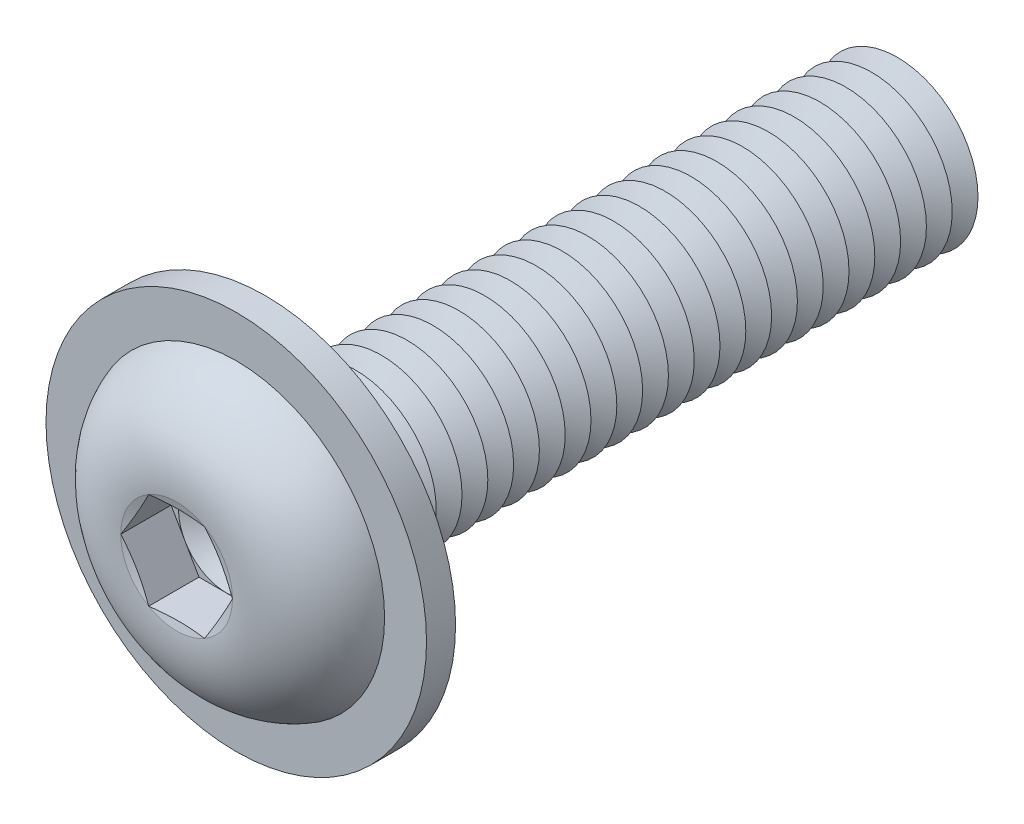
ISO-10303-21;
HEADER;
FILE_DESCRIPTION(('STEP AP214'),'2;1');
FILE_NAME('part.step','',(''),(''),'','','');
FILE_SCHEMA(('AUTOMOTIVE_DESIGN { 1 0 10303 214 1 1 1 1 }'));
ENDSEC;
DATA;
#1=APPLICATION_CONTEXT('core data for automotive mechanical design processes');
#2=APPLICATION_PROTOCOL_DEFINITION('international standard','automotive_design',2000,#1);
#3=PRODUCT_CONTEXT('',#1,'mechanical');
#4=PRODUCT('Part','Part','',(#3));
#5=PRODUCT_RELATED_PRODUCT_CATEGORY('part','',(#4));
#6=PRODUCT_DEFINITION_FORMATION('','',#4);
#7=PRODUCT_DEFINITION_CONTEXT('part definition',#1,'design');
#8=PRODUCT_DEFINITION('design','',#6,#7);
#9=PRODUCT_DEFINITION_SHAPE('','',#8);
#10=(LENGTH_UNIT() NAMED_UNIT(*) SI_UNIT(.MILLI.,.METRE.));
#11=(NAMED_UNIT(*) PLANE_ANGLE_UNIT() SI_UNIT($,.RADIAN.));
#12=(NAMED_UNIT(*) SI_UNIT($,.STERADIAN.) SOLID_ANGLE_UNIT());
#13=UNCERTAINTY_MEASURE_WITH_UNIT(LENGTH_MEASURE(1.E-05),#10,'distance_accuracy_value','');
#14=(GEOMETRIC_REPRESENTATION_CONTEXT(3) GLOBAL_UNCERTAINTY_ASSIGNED_CONTEXT((#13)) GLOBAL_UNIT_ASSIGNED_CONTEXT((#10,
#11,#12)) REPRESENTATION_CONTEXT('',''));
#15=CARTESIAN_POINT('',(0.,0.,0.));
#16=DIRECTION('',(0.,0.,1.));
#17=DIRECTION('',(1.,0.,0.));
#18=AXIS2_PLACEMENT_3D('',#15,#16,#17);
#19=CARTESIAN_POINT('',(0.,0.,-17.2));
#20=DIRECTION('',(0.,0.,1.));
#21=DIRECTION('',(1.,0.,0.));
#22=AXIS2_PLACEMENT_3D('',#19,#20,#21);
#23=CONICAL_SURFACE('',#22,2.50000000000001,1.0471975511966);
#24=CARTESIAN_POINT('',(0.,0.,-17.6));
#25=DIRECTION('',(0.,0.,1.));
#26=DIRECTION('',(1.,0.,0.));
#27=AXIS2_PLACEMENT_3D('',#24,#25,#26);
#28=CIRCLE('',#27,1.80717967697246);
#29=CARTESIAN_POINT('',(1.80717967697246,0.,-17.6));
#30=VERTEX_POINT('',#29);
#31=EDGE_CURVE('E410',#30,#30,#28,.T.);
#32=ORIENTED_EDGE('',*,*,#31,.T.);
#33=EDGE_LOOP('',(#32));
#34=FACE_BOUND('',#33,.T.);
#35=CARTESIAN_POINT('',(0.,0.,-17.2));
#36=DIRECTION('',(0.,0.,1.));
#37=DIRECTION('',(1.,0.,0.));
#38=AXIS2_PLACEMENT_3D('',#35,#36,#37);
#39=CIRCLE('',#38,2.50000000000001);
#40=CARTESIAN_POINT('',(2.50000000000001,0.,-17.2));
#41=VERTEX_POINT('',#40);
#42=EDGE_CURVE('E406',#41,#41,#39,.T.);
#43=ORIENTED_EDGE('',*,*,#42,.F.);
#44=EDGE_LOOP('',(#43));
#45=FACE_BOUND('',#44,.T.);
#46=ADVANCED_FACE('F39',(#34,#45),#23,.T.);
#47=CARTESIAN_POINT('',(0.,0.,-17.6));
#48=DIRECTION('',(0.,0.,-1.));
#49=DIRECTION('',(-1.,0.,0.));
#50=AXIS2_PLACEMENT_3D('',#47,#48,#49);
#51=CONICAL_SURFACE('',#50,1.80717967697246,1.0471975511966);
#52=CARTESIAN_POINT('',(0.,0.,-18.));
#53=DIRECTION('',(0.,0.,1.));
#54=DIRECTION('',(1.,0.,0.));
#55=AXIS2_PLACEMENT_3D('',#52,#53,#54);
#56=CIRCLE('',#55,2.50000000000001);
#57=CARTESIAN_POINT('',(2.50000000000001,0.,-18.));
#58=VERTEX_POINT('',#57);
#59=EDGE_CURVE('E414',#58,#58,#56,.T.);
#60=ORIENTED_EDGE('',*,*,#59,.T.);
#61=EDGE_LOOP('',(#60));
#62=FACE_BOUND('',#61,.T.);
#63=ORIENTED_EDGE('',*,*,#31,.F.);
#64=EDGE_LOOP('',(#63));
#65=FACE_BOUND('',#64,.T.);
#66=ADVANCED_FACE('F538',(#62,#65),#51,.T.);
#67=CARTESIAN_POINT('',(0.,2.50000000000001,-20.));
#68=DIRECTION('',(0.,0.,-1.));
#69=DIRECTION('',(-1.,0.,0.));
#70=AXIS2_PLACEMENT_3D('',#67,#68,#69);
#71=PLANE('',#70);
#72=CARTESIAN_POINT('',(0.,0.,-20.));
#73=DIRECTION('',(0.,0.,1.));
#74=DIRECTION('',(1.,0.,0.));
#75=AXIS2_PLACEMENT_3D('',#72,#73,#74);
#76=CIRCLE('',#75,1.80717967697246);
#77=CARTESIAN_POINT('',(1.80717967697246,0.,-20.));
#78=VERTEX_POINT('',#77);
#79=EDGE_CURVE('E434',#78,#78,#76,.T.);
#80=ORIENTED_EDGE('',*,*,#79,.F.);
#81=EDGE_LOOP('',(#80));
#82=FACE_BOUND('',#81,.T.);
#83=ADVANCED_FACE('F544',(#82),#71,.T.);
#84=CARTESIAN_POINT('',(0.,0.,-19.6));
#85=DIRECTION('',(0.,0.,1.));
#86=DIRECTION('',(1.,0.,0.));
#87=AXIS2_PLACEMENT_3D('',#84,#85,#86);
#88=CONICAL_SURFACE('',#87,2.50000000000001,1.0471975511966);
#89=ORIENTED_EDGE('',*,*,#79,.T.);
#90=EDGE_LOOP('',(#89));
#91=FACE_BOUND('',#90,.T.);
#92=CARTESIAN_POINT('',(0.,0.,-19.6));
#93=DIRECTION('',(0.,0.,1.));
#94=DIRECTION('',(1.,0.,0.));
#95=AXIS2_PLACEMENT_3D('',#92,#93,#94);
#96=CIRCLE('',#95,2.50000000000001);
#97=CARTESIAN_POINT('',(2.50000000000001,0.,-19.6));
#98=VERTEX_POINT('',#97);
#99=EDGE_CURVE('E430',#98,#98,#96,.T.);
#100=ORIENTED_EDGE('',*,*,#99,.F.);
#101=EDGE_LOOP('',(#100));
#102=FACE_BOUND('',#101,.T.);
#103=ADVANCED_FACE('F563',(#91,#102),#88,.T.);
#104=CARTESIAN_POINT('',(0.,0.,-19.2));
#105=DIRECTION('',(0.,0.,-1.));
#106=DIRECTION('',(-1.,0.,0.));
#107=AXIS2_PLACEMENT_3D('',#104,#105,#106);
#108=CONICAL_SURFACE('',#107,1.80717967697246,1.0471975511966);
#109=ORIENTED_EDGE('',*,*,#99,.T.);
#110=EDGE_LOOP('',(#109));
#111=FACE_BOUND('',#110,.T.);
#112=CARTESIAN_POINT('',(0.,0.,-19.2));
#113=DIRECTION('',(0.,0.,1.));
#114=DIRECTION('',(1.,0.,0.));
#115=AXIS2_PLACEMENT_3D('',#112,#113,#114);
#116=CIRCLE('',#115,1.80717967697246);
#117=CARTESIAN_POINT('',(1.80717967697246,0.,-19.2));
#118=VERTEX_POINT('',#117);
#119=EDGE_CURVE('E426',#118,#118,#116,.T.);
#120=ORIENTED_EDGE('',*,*,#119,.F.);
#121=EDGE_LOOP('',(#120));
#122=FACE_BOUND('',#121,.T.);
#123=ADVANCED_FACE('F560',(#111,#122),#108,.T.);
#124=CARTESIAN_POINT('',(0.,0.,-18.8));
#125=DIRECTION('',(0.,0.,1.));
#126=DIRECTION('',(1.,0.,0.));
#127=AXIS2_PLACEMENT_3D('',#124,#125,#126);
#128=CONICAL_SURFACE('',#127,2.50000000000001,1.0471975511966);
#129=ORIENTED_EDGE('',*,*,#119,.T.);
#130=EDGE_LOOP('',(#129));
#131=FACE_BOUND('',#130,.T.);
#132=CARTESIAN_POINT('',(0.,0.,-18.8));
#133=DIRECTION('',(0.,0.,1.));
#134=DIRECTION('',(1.,0.,0.));
#135=AXIS2_PLACEMENT_3D('',#132,#133,#134);
#136=CIRCLE('',#135,2.50000000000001);
#137=CARTESIAN_POINT('',(2.50000000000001,0.,-18.8));
#138=VERTEX_POINT('',#137);
#139=EDGE_CURVE('E422',#138,#138,#136,.T.);
#140=ORIENTED_EDGE('',*,*,#139,.F.);
#141=EDGE_LOOP('',(#140));
#142=FACE_BOUND('',#141,.T.);
#143=ADVANCED_FACE('F554',(#131,#142),#128,.T.);
#144=CARTESIAN_POINT('',(0.,0.,-18.4));
#145=DIRECTION('',(0.,0.,-1.));
#146=DIRECTION('',(-1.,0.,0.));
#147=AXIS2_PLACEMENT_3D('',#144,#145,#146);
#148=CONICAL_SURFACE('',#147,1.80717967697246,1.0471975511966);
#149=ORIENTED_EDGE('',*,*,#139,.T.);
#150=EDGE_LOOP('',(#149));
#151=FACE_BOUND('',#150,.T.);
#152=CARTESIAN_POINT('',(0.,0.,-18.4));
#153=DIRECTION('',(0.,0.,1.));
#154=DIRECTION('',(1.,0.,0.));
#155=AXIS2_PLACEMENT_3D('',#152,#153,#154);
#156=CIRCLE('',#155,1.80717967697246);
#157=CARTESIAN_POINT('',(1.80717967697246,0.,-18.4));
#158=VERTEX_POINT('',#157);
#159=EDGE_CURVE('E418',#158,#158,#156,.T.);
#160=ORIENTED_EDGE('',*,*,#159,.F.);
#161=EDGE_LOOP('',(#160));
#162=FACE_BOUND('',#161,.T.);
#163=ADVANCED_FACE('F550',(#151,#162),#148,.T.);
#164=CARTESIAN_POINT('',(0.,0.,-18.));
#165=DIRECTION('',(0.,0.,1.));
#166=DIRECTION('',(1.,0.,0.));
#167=AXIS2_PLACEMENT_3D('',#164,#165,#166);
#168=CONICAL_SURFACE('',#167,2.50000000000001,1.0471975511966);
#169=ORIENTED_EDGE('',*,*,#159,.T.);
#170=EDGE_LOOP('',(#169));
#171=FACE_BOUND('',#170,.T.);
#172=ORIENTED_EDGE('',*,*,#59,.F.);
#173=EDGE_LOOP('',(#172));
#174=FACE_BOUND('',#173,.T.);
#175=ADVANCED_FACE('F553',(#171,#174),#168,.T.);
#176=CARTESIAN_POINT('',(0.,0.,-16.4));
#177=DIRECTION('',(0.,0.,1.));
#178=DIRECTION('',(1.,0.,0.));
#179=AXIS2_PLACEMENT_3D('',#176,#177,#178);
#180=CONICAL_SURFACE('',#179,2.50000000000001,1.0471975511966);
#181=CARTESIAN_POINT('',(0.,0.,-16.8));
#182=DIRECTION('',(0.,0.,1.));
#183=DIRECTION('',(1.,0.,0.));
#184=AXIS2_PLACEMENT_3D('',#181,#182,#183);
#185=CIRCLE('',#184,1.80717967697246);
#186=CARTESIAN_POINT('',(1.80717967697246,0.,-16.8));
#187=VERTEX_POINT('',#186);
#188=EDGE_CURVE('E402',#187,#187,#185,.T.);
#189=ORIENTED_EDGE('',*,*,#188,.T.);
#190=EDGE_LOOP('',(#189));
#191=FACE_BOUND('',#190,.T.);
#192=CARTESIAN_POINT('',(0.,0.,-16.4));
#193=DIRECTION('',(0.,0.,1.));
#194=DIRECTION('',(1.,0.,0.));
#195=AXIS2_PLACEMENT_3D('',#192,#193,#194);
#196=CIRCLE('',#195,2.50000000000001);
#197=CARTESIAN_POINT('',(2.50000000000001,0.,-16.4));
#198=VERTEX_POINT('',#197);
#199=EDGE_CURVE('E398',#198,#198,#196,.T.);
#200=ORIENTED_EDGE('',*,*,#199,.F.);
#201=EDGE_LOOP('',(#200));
#202=FACE_BOUND('',#201,.T.);
#203=ADVANCED_FACE('F558',(#191,#202),#180,.T.);
#204=CARTESIAN_POINT('',(0.,0.,-16.8));
#205=DIRECTION('',(0.,0.,-1.));
#206=DIRECTION('',(-1.,0.,0.));
#207=AXIS2_PLACEMENT_3D('',#204,#205,#206);
#208=CONICAL_SURFACE('',#207,1.80717967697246,1.0471975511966);
#209=ORIENTED_EDGE('',*,*,#42,.T.);
#210=EDGE_LOOP('',(#209));
#211=FACE_BOUND('',#210,.T.);
#212=ORIENTED_EDGE('',*,*,#188,.F.);
#213=EDGE_LOOP('',(#212));
#214=FACE_BOUND('',#213,.T.);
#215=ADVANCED_FACE('F609',(#211,#214),#208,.T.);
#216=CARTESIAN_POINT('',(0.,0.,-15.6));
#217=DIRECTION('',(0.,0.,1.));
#218=DIRECTION('',(1.,0.,0.));
#219=AXIS2_PLACEMENT_3D('',#216,#217,#218);
#220=CONICAL_SURFACE('',#219,2.50000000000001,1.0471975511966);
#221=CARTESIAN_POINT('',(0.,0.,-16.));
#222=DIRECTION('',(0.,0.,1.));
#223=DIRECTION('',(1.,0.,0.));
#224=AXIS2_PLACEMENT_3D('',#221,#222,#223);
#225=CIRCLE('',#224,1.80717967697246);
#226=CARTESIAN_POINT('',(1.80717967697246,0.,-16.));
#227=VERTEX_POINT('',#226);
#228=EDGE_CURVE('E394',#227,#227,#225,.T.);
#229=ORIENTED_EDGE('',*,*,#228,.T.);
#230=EDGE_LOOP('',(#229));
#231=FACE_BOUND('',#230,.T.);
#232=CARTESIAN_POINT('',(0.,0.,-15.6));
#233=DIRECTION('',(0.,0.,1.));
#234=DIRECTION('',(1.,0.,0.));
#235=AXIS2_PLACEMENT_3D('',#232,#233,#234);
#236=CIRCLE('',#235,2.50000000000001);
#237=CARTESIAN_POINT('',(2.50000000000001,0.,-15.6));
#238=VERTEX_POINT('',#237);
#239=EDGE_CURVE('E390',#238,#238,#236,.T.);
#240=ORIENTED_EDGE('',*,*,#239,.F.);
#241=EDGE_LOOP('',(#240));
#242=FACE_BOUND('',#241,.T.);
#243=ADVANCED_FACE('F615',(#231,#242),#220,.T.);
#244=CARTESIAN_POINT('',(0.,0.,-16.));
#245=DIRECTION('',(0.,0.,-1.));
#246=DIRECTION('',(-1.,0.,0.));
#247=AXIS2_PLACEMENT_3D('',#244,#245,#246);
#248=CONICAL_SURFACE('',#247,1.80717967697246,1.0471975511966);
#249=ORIENTED_EDGE('',*,*,#199,.T.);
#250=EDGE_LOOP('',(#249));
#251=FACE_BOUND('',#250,.T.);
#252=ORIENTED_EDGE('',*,*,#228,.F.);
#253=EDGE_LOOP('',(#252));
#254=FACE_BOUND('',#253,.T.);
#255=ADVANCED_FACE('F622',(#251,#254),#248,.T.);
#256=CARTESIAN_POINT('',(0.,0.,-14.8));
#257=DIRECTION('',(0.,0.,1.));
#258=DIRECTION('',(1.,0.,0.));
#259=AXIS2_PLACEMENT_3D('',#256,#257,#258);
#260=CONICAL_SURFACE('',#259,2.50000000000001,1.0471975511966);
#261=CARTESIAN_POINT('',(0.,0.,-15.2));
#262=DIRECTION('',(0.,0.,1.));
#263=DIRECTION('',(1.,0.,0.));
#264=AXIS2_PLACEMENT_3D('',#261,#262,#263);
#265=CIRCLE('',#264,1.80717967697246);
#266=CARTESIAN_POINT('',(1.80717967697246,0.,-15.2));
#267=VERTEX_POINT('',#266);
#268=EDGE_CURVE('E386',#267,#267,#265,.T.);
#269=ORIENTED_EDGE('',*,*,#268,.T.);
#270=EDGE_LOOP('',(#269));
#271=FACE_BOUND('',#270,.T.);
#272=CARTESIAN_POINT('',(0.,0.,-14.8));
#273=DIRECTION('',(0.,0.,1.));
#274=DIRECTION('',(1.,0.,0.));
#275=AXIS2_PLACEMENT_3D('',#272,#273,#274);
#276=CIRCLE('',#275,2.50000000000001);
#277=CARTESIAN_POINT('',(2.50000000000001,0.,-14.8));
#278=VERTEX_POINT('',#277);
#279=EDGE_CURVE('E382',#278,#278,#276,.T.);
#280=ORIENTED_EDGE('',*,*,#279,.F.);
#281=EDGE_LOOP('',(#280));
#282=FACE_BOUND('',#281,.T.);
#283=ADVANCED_FACE('F629',(#271,#282),#260,.T.);
#284=CARTESIAN_POINT('',(0.,0.,-15.2));
#285=DIRECTION('',(0.,0.,-1.));
#286=DIRECTION('',(-1.,0.,0.));
#287=AXIS2_PLACEMENT_3D('',#284,#285,#286);
#288=CONICAL_SURFACE('',#287,1.80717967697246,1.0471975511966);
#289=ORIENTED_EDGE('',*,*,#239,.T.);
#290=EDGE_LOOP('',(#289));
#291=FACE_BOUND('',#290,.T.);
#292=ORIENTED_EDGE('',*,*,#268,.F.);
#293=EDGE_LOOP('',(#292));
#294=FACE_BOUND('',#293,.T.);
#295=ADVANCED_FACE('F636',(#291,#294),#288,.T.);
#296=CARTESIAN_POINT('',(0.,0.,-14.));
#297=DIRECTION('',(0.,0.,1.));
#298=DIRECTION('',(1.,0.,0.));
#299=AXIS2_PLACEMENT_3D('',#296,#297,#298);
#300=CONICAL_SURFACE('',#299,2.50000000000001,1.0471975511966);
#301=CARTESIAN_POINT('',(0.,0.,-14.4));
#302=DIRECTION('',(0.,0.,1.));
#303=DIRECTION('',(1.,0.,0.));
#304=AXIS2_PLACEMENT_3D('',#301,#302,#303);
#305=CIRCLE('',#304,1.80717967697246);
#306=CARTESIAN_POINT('',(1.80717967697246,0.,-14.4));
#307=VERTEX_POINT('',#306);
#308=EDGE_CURVE('E378',#307,#307,#305,.T.);
#309=ORIENTED_EDGE('',*,*,#308,.T.);
#310=EDGE_LOOP('',(#309));
#311=FACE_BOUND('',#310,.T.);
#312=CARTESIAN_POINT('',(0.,0.,-14.));
#313=DIRECTION('',(0.,0.,1.));
#314=DIRECTION('',(1.,0.,0.));
#315=AXIS2_PLACEMENT_3D('',#312,#313,#314);
#316=CIRCLE('',#315,2.50000000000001);
#317=CARTESIAN_POINT('',(2.50000000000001,0.,-14.));
#318=VERTEX_POINT('',#317);
#319=EDGE_CURVE('E374',#318,#318,#316,.T.);
#320=ORIENTED_EDGE('',*,*,#319,.F.);
#321=EDGE_LOOP('',(#320));
#322=FACE_BOUND('',#321,.T.);
#323=ADVANCED_FACE('F643',(#311,#322),#300,.T.);
#324=CARTESIAN_POINT('',(0.,0.,-14.4));
#325=DIRECTION('',(0.,0.,-1.));
#326=DIRECTION('',(-1.,0.,0.));
#327=AXIS2_PLACEMENT_3D('',#324,#325,#326);
#328=CONICAL_SURFACE('',#327,1.80717967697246,1.0471975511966);
#329=ORIENTED_EDGE('',*,*,#279,.T.);
#330=EDGE_LOOP('',(#329));
#331=FACE_BOUND('',#330,.T.);
#332=ORIENTED_EDGE('',*,*,#308,.F.);
#333=EDGE_LOOP('',(#332));
#334=FACE_BOUND('',#333,.T.);
#335=ADVANCED_FACE('F650',(#331,#334),#328,.T.);
#336=CARTESIAN_POINT('',(0.,0.,-13.2));
#337=DIRECTION('',(0.,0.,1.));
#338=DIRECTION('',(1.,0.,0.));
#339=AXIS2_PLACEMENT_3D('',#336,#337,#338);
#340=CONICAL_SURFACE('',#339,2.50000000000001,1.0471975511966);
#341=CARTESIAN_POINT('',(0.,0.,-13.6));
#342=DIRECTION('',(0.,0.,1.));
#343=DIRECTION('',(1.,0.,0.));
#344=AXIS2_PLACEMENT_3D('',#341,#342,#343);
#345=CIRCLE('',#344,1.80717967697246);
#346=CARTESIAN_POINT('',(1.80717967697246,0.,-13.6));
#347=VERTEX_POINT('',#346);
#348=EDGE_CURVE('E370',#347,#347,#345,.T.);
#349=ORIENTED_EDGE('',*,*,#348,.T.);
#350=EDGE_LOOP('',(#349));
#351=FACE_BOUND('',#350,.T.);
#352=CARTESIAN_POINT('',(0.,0.,-13.2));
#353=DIRECTION('',(0.,0.,1.));
#354=DIRECTION('',(1.,0.,0.));
#355=AXIS2_PLACEMENT_3D('',#352,#353,#354);
#356=CIRCLE('',#355,2.50000000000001);
#357=CARTESIAN_POINT('',(2.50000000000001,0.,-13.2));
#358=VERTEX_POINT('',#357);
#359=EDGE_CURVE('E366',#358,#358,#356,.T.);
#360=ORIENTED_EDGE('',*,*,#359,.F.);
#361=EDGE_LOOP('',(#360));
#362=FACE_BOUND('',#361,.T.);
#363=ADVANCED_FACE('F657',(#351,#362),#340,.T.);
#364=CARTESIAN_POINT('',(0.,0.,-13.6));
#365=DIRECTION('',(0.,0.,-1.));
#366=DIRECTION('',(-1.,0.,0.));
#367=AXIS2_PLACEMENT_3D('',#364,#365,#366);
#368=CONICAL_SURFACE('',#367,1.80717967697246,1.0471975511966);
#369=ORIENTED_EDGE('',*,*,#319,.T.);
#370=EDGE_LOOP('',(#369));
#371=FACE_BOUND('',#370,.T.);
#372=ORIENTED_EDGE('',*,*,#348,.F.);
#373=EDGE_LOOP('',(#372));
#374=FACE_BOUND('',#373,.T.);
#375=ADVANCED_FACE('F664',(#371,#374),#368,.T.);
#376=CARTESIAN_POINT('',(0.,0.,-12.4));
#377=DIRECTION('',(0.,0.,1.));
#378=DIRECTION('',(1.,0.,0.));
#379=AXIS2_PLACEMENT_3D('',#376,#377,#378);
#380=CONICAL_SURFACE('',#379,2.50000000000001,1.0471975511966);
#381=CARTESIAN_POINT('',(0.,0.,-12.8));
#382=DIRECTION('',(0.,0.,1.));
#383=DIRECTION('',(1.,0.,0.));
#384=AXIS2_PLACEMENT_3D('',#381,#382,#383);
#385=CIRCLE('',#384,1.80717967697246);
#386=CARTESIAN_POINT('',(1.80717967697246,0.,-12.8));
#387=VERTEX_POINT('',#386);
#388=EDGE_CURVE('E362',#387,#387,#385,.T.);
#389=ORIENTED_EDGE('',*,*,#388,.T.);
#390=EDGE_LOOP('',(#389));
#391=FACE_BOUND('',#390,.T.);
#392=CARTESIAN_POINT('',(0.,0.,-12.4));
#393=DIRECTION('',(0.,0.,1.));
#394=DIRECTION('',(1.,0.,0.));
#395=AXIS2_PLACEMENT_3D('',#392,#393,#394);
#396=CIRCLE('',#395,2.50000000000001);
#397=CARTESIAN_POINT('',(2.50000000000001,0.,-12.4));
#398=VERTEX_POINT('',#397);
#399=EDGE_CURVE('E358',#398,#398,#396,.T.);
#400=ORIENTED_EDGE('',*,*,#399,.F.);
#401=EDGE_LOOP('',(#400));
#402=FACE_BOUND('',#401,.T.);
#403=ADVANCED_FACE('F671',(#391,#402),#380,.T.);
#404=CARTESIAN_POINT('',(0.,0.,-12.8));
#405=DIRECTION('',(0.,0.,-1.));
#406=DIRECTION('',(-1.,0.,0.));
#407=AXIS2_PLACEMENT_3D('',#404,#405,#406);
#408=CONICAL_SURFACE('',#407,1.80717967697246,1.0471975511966);
#409=ORIENTED_EDGE('',*,*,#359,.T.);
#410=EDGE_LOOP('',(#409));
#411=FACE_BOUND('',#410,.T.);
#412=ORIENTED_EDGE('',*,*,#388,.F.);
#413=EDGE_LOOP('',(#412));
#414=FACE_BOUND('',#413,.T.);
#415=ADVANCED_FACE('F678',(#411,#414),#408,.T.);
#416=CARTESIAN_POINT('',(0.,0.,-11.6));
#417=DIRECTION('',(0.,0.,1.));
#418=DIRECTION('',(1.,0.,0.));
#419=AXIS2_PLACEMENT_3D('',#416,#417,#418);
#420=CONICAL_SURFACE('',#419,2.50000000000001,1.0471975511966);
#421=CARTESIAN_POINT('',(0.,0.,-12.));
#422=DIRECTION('',(0.,0.,1.));
#423=DIRECTION('',(1.,0.,0.));
#424=AXIS2_PLACEMENT_3D('',#421,#422,#423);
#425=CIRCLE('',#424,1.80717967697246);
#426=CARTESIAN_POINT('',(1.80717967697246,0.,-12.));
#427=VERTEX_POINT('',#426);
#428=EDGE_CURVE('E354',#427,#427,#425,.T.);
#429=ORIENTED_EDGE('',*,*,#428,.T.);
#430=EDGE_LOOP('',(#429));
#431=FACE_BOUND('',#430,.T.);
#432=CARTESIAN_POINT('',(0.,0.,-11.6));
#433=DIRECTION('',(0.,0.,1.));
#434=DIRECTION('',(1.,0.,0.));
#435=AXIS2_PLACEMENT_3D('',#432,#433,#434);
#436=CIRCLE('',#435,2.50000000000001);
#437=CARTESIAN_POINT('',(2.50000000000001,0.,-11.6));
#438=VERTEX_POINT('',#437);
#439=EDGE_CURVE('E350',#438,#438,#436,.T.);
#440=ORIENTED_EDGE('',*,*,#439,.F.);
#441=EDGE_LOOP('',(#440));
#442=FACE_BOUND('',#441,.T.);
#443=ADVANCED_FACE('F685',(#431,#442),#420,.T.);
#444=CARTESIAN_POINT('',(0.,0.,-12.));
#445=DIRECTION('',(0.,0.,-1.));
#446=DIRECTION('',(-1.,0.,0.));
#447=AXIS2_PLACEMENT_3D('',#444,#445,#446);
#448=CONICAL_SURFACE('',#447,1.80717967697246,1.0471975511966);
#449=ORIENTED_EDGE('',*,*,#399,.T.);
#450=EDGE_LOOP('',(#449));
#451=FACE_BOUND('',#450,.T.);
#452=ORIENTED_EDGE('',*,*,#428,.F.);
#453=EDGE_LOOP('',(#452));
#454=FACE_BOUND('',#453,.T.);
#455=ADVANCED_FACE('F692',(#451,#454),#448,.T.);
#456=CARTESIAN_POINT('',(0.,0.,-10.8));
#457=DIRECTION('',(0.,0.,1.));
#458=DIRECTION('',(1.,0.,0.));
#459=AXIS2_PLACEMENT_3D('',#456,#457,#458);
#460=CONICAL_SURFACE('',#459,2.50000000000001,1.0471975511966);
#461=CARTESIAN_POINT('',(0.,0.,-11.2));
#462=DIRECTION('',(0.,0.,1.));
#463=DIRECTION('',(1.,0.,0.));
#464=AXIS2_PLACEMENT_3D('',#461,#462,#463);
#465=CIRCLE('',#464,1.80717967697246);
#466=CARTESIAN_POINT('',(1.80717967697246,0.,-11.2));
#467=VERTEX_POINT('',#466);
#468=EDGE_CURVE('E346',#467,#467,#465,.T.);
#469=ORIENTED_EDGE('',*,*,#468,.T.);
#470=EDGE_LOOP('',(#469));
#471=FACE_BOUND('',#470,.T.);
#472=CARTESIAN_POINT('',(0.,0.,-10.8));
#473=DIRECTION('',(0.,0.,1.));
#474=DIRECTION('',(1.,0.,0.));
#475=AXIS2_PLACEMENT_3D('',#472,#473,#474);
#476=CIRCLE('',#475,2.50000000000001);
#477=CARTESIAN_POINT('',(2.50000000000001,0.,-10.8));
#478=VERTEX_POINT('',#477);
#479=EDGE_CURVE('E342',#478,#478,#476,.T.);
#480=ORIENTED_EDGE('',*,*,#479,.F.);
#481=EDGE_LOOP('',(#480));
#482=FACE_BOUND('',#481,.T.);
#483=ADVANCED_FACE('F699',(#471,#482),#460,.T.);
#484=CARTESIAN_POINT('',(0.,0.,-11.2));
#485=DIRECTION('',(0.,0.,-1.));
#486=DIRECTION('',(-1.,0.,0.));
#487=AXIS2_PLACEMENT_3D('',#484,#485,#486);
#488=CONICAL_SURFACE('',#487,1.80717967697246,1.0471975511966);
#489=ORIENTED_EDGE('',*,*,#439,.T.);
#490=EDGE_LOOP('',(#489));
#491=FACE_BOUND('',#490,.T.);
#492=ORIENTED_EDGE('',*,*,#468,.F.);
#493=EDGE_LOOP('',(#492));
#494=FACE_BOUND('',#493,.T.);
#495=ADVANCED_FACE('F706',(#491,#494),#488,.T.);
#496=CARTESIAN_POINT('',(0.,0.,-10.));
#497=DIRECTION('',(0.,0.,1.));
#498=DIRECTION('',(1.,0.,0.));
#499=AXIS2_PLACEMENT_3D('',#496,#497,#498);
#500=CONICAL_SURFACE('',#499,2.50000000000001,1.0471975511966);
#501=CARTESIAN_POINT('',(0.,0.,-10.4));
#502=DIRECTION('',(0.,0.,1.));
#503=DIRECTION('',(1.,0.,0.));
#504=AXIS2_PLACEMENT_3D('',#501,#502,#503);
#505=CIRCLE('',#504,1.80717967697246);
#506=CARTESIAN_POINT('',(1.80717967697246,0.,-10.4));
#507=VERTEX_POINT('',#506);
#508=EDGE_CURVE('E338',#507,#507,#505,.T.);
#509=ORIENTED_EDGE('',*,*,#508,.T.);
#510=EDGE_LOOP('',(#509));
#511=FACE_BOUND('',#510,.T.);
#512=CARTESIAN_POINT('',(0.,0.,-10.));
#513=DIRECTION('',(0.,0.,1.));
#514=DIRECTION('',(1.,0.,0.));
#515=AXIS2_PLACEMENT_3D('',#512,#513,#514);
#516=CIRCLE('',#515,2.50000000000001);
#517=CARTESIAN_POINT('',(2.50000000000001,0.,-10.));
#518=VERTEX_POINT('',#517);
#519=EDGE_CURVE('E334',#518,#518,#516,.T.);
#520=ORIENTED_EDGE('',*,*,#519,.F.);
#521=EDGE_LOOP('',(#520));
#522=FACE_BOUND('',#521,.T.);
#523=ADVANCED_FACE('F713',(#511,#522),#500,.T.);
#524=CARTESIAN_POINT('',(0.,0.,-10.4));
#525=DIRECTION('',(0.,0.,-1.));
#526=DIRECTION('',(-1.,0.,0.));
#527=AXIS2_PLACEMENT_3D('',#524,#525,#526);
#528=CONICAL_SURFACE('',#527,1.80717967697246,1.0471975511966);
#529=ORIENTED_EDGE('',*,*,#479,.T.);
#530=EDGE_LOOP('',(#529));
#531=FACE_BOUND('',#530,.T.);
#532=ORIENTED_EDGE('',*,*,#508,.F.);
#533=EDGE_LOOP('',(#532));
#534=FACE_BOUND('',#533,.T.);
#535=ADVANCED_FACE('F720',(#531,#534),#528,.T.);
#536=CARTESIAN_POINT('',(0.,0.,-9.2));
#537=DIRECTION('',(0.,0.,1.));
#538=DIRECTION('',(1.,0.,0.));
#539=AXIS2_PLACEMENT_3D('',#536,#537,#538);
#540=CONICAL_SURFACE('',#539,2.50000000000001,1.0471975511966);
#541=CARTESIAN_POINT('',(0.,0.,-9.6));
#542=DIRECTION('',(0.,0.,1.));
#543=DIRECTION('',(1.,0.,0.));
#544=AXIS2_PLACEMENT_3D('',#541,#542,#543);
#545=CIRCLE('',#544,1.80717967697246);
#546=CARTESIAN_POINT('',(1.80717967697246,0.,-9.6));
#547=VERTEX_POINT('',#546);
#548=EDGE_CURVE('E330',#547,#547,#545,.T.);
#549=ORIENTED_EDGE('',*,*,#548,.T.);
#550=EDGE_LOOP('',(#549));
#551=FACE_BOUND('',#550,.T.);
#552=CARTESIAN_POINT('',(0.,0.,-9.2));
#553=DIRECTION('',(0.,0.,1.));
#554=DIRECTION('',(1.,0.,0.));
#555=AXIS2_PLACEMENT_3D('',#552,#553,#554);
#556=CIRCLE('',#555,2.50000000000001);
#557=CARTESIAN_POINT('',(2.50000000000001,0.,-9.2));
#558=VERTEX_POINT('',#557);
#559=EDGE_CURVE('E326',#558,#558,#556,.T.);
#560=ORIENTED_EDGE('',*,*,#559,.F.);
#561=EDGE_LOOP('',(#560));
#562=FACE_BOUND('',#561,.T.);
#563=ADVANCED_FACE('F727',(#551,#562),#540,.T.);
#564=CARTESIAN_POINT('',(0.,0.,-9.6));
#565=DIRECTION('',(0.,0.,-1.));
#566=DIRECTION('',(-1.,0.,0.));
#567=AXIS2_PLACEMENT_3D('',#564,#565,#566);
#568=CONICAL_SURFACE('',#567,1.80717967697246,1.0471975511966);
#569=ORIENTED_EDGE('',*,*,#519,.T.);
#570=EDGE_LOOP('',(#569));
#571=FACE_BOUND('',#570,.T.);
#572=ORIENTED_EDGE('',*,*,#548,.F.);
#573=EDGE_LOOP('',(#572));
#574=FACE_BOUND('',#573,.T.);
#575=ADVANCED_FACE('F734',(#571,#574),#568,.T.);
#576=CARTESIAN_POINT('',(0.,0.,-8.4));
#577=DIRECTION('',(0.,0.,1.));
#578=DIRECTION('',(1.,0.,0.));
#579=AXIS2_PLACEMENT_3D('',#576,#577,#578);
#580=CONICAL_SURFACE('',#579,2.50000000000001,1.0471975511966);
#581=CARTESIAN_POINT('',(0.,0.,-8.8));
#582=DIRECTION('',(0.,0.,1.));
#583=DIRECTION('',(1.,0.,0.));
#584=AXIS2_PLACEMENT_3D('',#581,#582,#583);
#585=CIRCLE('',#584,1.80717967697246);
#586=CARTESIAN_POINT('',(1.80717967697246,0.,-8.8));
#587=VERTEX_POINT('',#586);
#588=EDGE_CURVE('E322',#587,#587,#585,.T.);
#589=ORIENTED_EDGE('',*,*,#588,.T.);
#590=EDGE_LOOP('',(#589));
#591=FACE_BOUND('',#590,.T.);
#592=CARTESIAN_POINT('',(0.,0.,-8.4));
#593=DIRECTION('',(0.,0.,1.));
#594=DIRECTION('',(1.,0.,0.));
#595=AXIS2_PLACEMENT_3D('',#592,#593,#594);
#596=CIRCLE('',#595,2.50000000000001);
#597=CARTESIAN_POINT('',(2.50000000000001,0.,-8.4));
#598=VERTEX_POINT('',#597);
#599=EDGE_CURVE('E318',#598,#598,#596,.T.);
#600=ORIENTED_EDGE('',*,*,#599,.F.);
#601=EDGE_LOOP('',(#600));
#602=FACE_BOUND('',#601,.T.);
#603=ADVANCED_FACE('F741',(#591,#602),#580,.T.);
#604=CARTESIAN_POINT('',(0.,0.,-8.8));
#605=DIRECTION('',(0.,0.,-1.));
#606=DIRECTION('',(-1.,0.,0.));
#607=AXIS2_PLACEMENT_3D('',#604,#605,#606);
#608=CONICAL_SURFACE('',#607,1.80717967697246,1.0471975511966);
#609=ORIENTED_EDGE('',*,*,#559,.T.);
#610=EDGE_LOOP('',(#609));
#611=FACE_BOUND('',#610,.T.);
#612=ORIENTED_EDGE('',*,*,#588,.F.);
#613=EDGE_LOOP('',(#612));
#614=FACE_BOUND('',#613,.T.);
#615=ADVANCED_FACE('F748',(#611,#614),#608,.T.);
#616=CARTESIAN_POINT('',(0.,0.,-7.6));
#617=DIRECTION('',(0.,0.,1.));
#618=DIRECTION('',(1.,0.,0.));
#619=AXIS2_PLACEMENT_3D('',#616,#617,#618);
#620=CONICAL_SURFACE('',#619,2.50000000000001,1.0471975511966);
#621=CARTESIAN_POINT('',(0.,0.,-8.));
#622=DIRECTION('',(0.,0.,1.));
#623=DIRECTION('',(1.,0.,0.));
#624=AXIS2_PLACEMENT_3D('',#621,#622,#623);
#625=CIRCLE('',#624,1.80717967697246);
#626=CARTESIAN_POINT('',(1.80717967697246,0.,-8.));
#627=VERTEX_POINT('',#626);
#628=EDGE_CURVE('E314',#627,#627,#625,.T.);
#629=ORIENTED_EDGE('',*,*,#628,.T.);
#630=EDGE_LOOP('',(#629));
#631=FACE_BOUND('',#630,.T.);
#632=CARTESIAN_POINT('',(0.,0.,-7.6));
#633=DIRECTION('',(0.,0.,1.));
#634=DIRECTION('',(1.,0.,0.));
#635=AXIS2_PLACEMENT_3D('',#632,#633,#634);
#636=CIRCLE('',#635,2.50000000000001);
#637=CARTESIAN_POINT('',(2.50000000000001,0.,-7.6));
#638=VERTEX_POINT('',#637);
#639=EDGE_CURVE('E310',#638,#638,#636,.T.);
#640=ORIENTED_EDGE('',*,*,#639,.F.);
#641=EDGE_LOOP('',(#640));
#642=FACE_BOUND('',#641,.T.);
#643=ADVANCED_FACE('F755',(#631,#642),#620,.T.);
#644=CARTESIAN_POINT('',(0.,0.,-8.));
#645=DIRECTION('',(0.,0.,-1.));
#646=DIRECTION('',(-1.,0.,0.));
#647=AXIS2_PLACEMENT_3D('',#644,#645,#646);
#648=CONICAL_SURFACE('',#647,1.80717967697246,1.0471975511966);
#649=ORIENTED_EDGE('',*,*,#599,.T.);
#650=EDGE_LOOP('',(#649));
#651=FACE_BOUND('',#650,.T.);
#652=ORIENTED_EDGE('',*,*,#628,.F.);
#653=EDGE_LOOP('',(#652));
#654=FACE_BOUND('',#653,.T.);
#655=ADVANCED_FACE('F762',(#651,#654),#648,.T.);
#656=CARTESIAN_POINT('',(0.,0.,-6.8));
#657=DIRECTION('',(0.,0.,1.));
#658=DIRECTION('',(1.,0.,0.));
#659=AXIS2_PLACEMENT_3D('',#656,#657,#658);
#660=CONICAL_SURFACE('',#659,2.50000000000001,1.0471975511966);
#661=CARTESIAN_POINT('',(0.,0.,-7.2));
#662=DIRECTION('',(0.,0.,1.));
#663=DIRECTION('',(1.,0.,0.));
#664=AXIS2_PLACEMENT_3D('',#661,#662,#663);
#665=CIRCLE('',#664,1.80717967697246);
#666=CARTESIAN_POINT('',(1.80717967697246,0.,-7.2));
#667=VERTEX_POINT('',#666);
#668=EDGE_CURVE('E306',#667,#667,#665,.T.);
#669=ORIENTED_EDGE('',*,*,#668,.T.);
#670=EDGE_LOOP('',(#669));
#671=FACE_BOUND('',#670,.T.);
#672=CARTESIAN_POINT('',(0.,0.,-6.8));
#673=DIRECTION('',(0.,0.,1.));
#674=DIRECTION('',(1.,0.,0.));
#675=AXIS2_PLACEMENT_3D('',#672,#673,#674);
#676=CIRCLE('',#675,2.50000000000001);
#677=CARTESIAN_POINT('',(2.50000000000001,0.,-6.8));
#678=VERTEX_POINT('',#677);
#679=EDGE_CURVE('E302',#678,#678,#676,.T.);
#680=ORIENTED_EDGE('',*,*,#679,.F.);
#681=EDGE_LOOP('',(#680));
#682=FACE_BOUND('',#681,.T.);
#683=ADVANCED_FACE('F769',(#671,#682),#660,.T.);
#684=CARTESIAN_POINT('',(0.,0.,-7.2));
#685=DIRECTION('',(0.,0.,-1.));
#686=DIRECTION('',(-1.,0.,0.));
#687=AXIS2_PLACEMENT_3D('',#684,#685,#686);
#688=CONICAL_SURFACE('',#687,1.80717967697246,1.0471975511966);
#689=ORIENTED_EDGE('',*,*,#639,.T.);
#690=EDGE_LOOP('',(#689));
#691=FACE_BOUND('',#690,.T.);
#692=ORIENTED_EDGE('',*,*,#668,.F.);
#693=EDGE_LOOP('',(#692));
#694=FACE_BOUND('',#693,.T.);
#695=ADVANCED_FACE('F776',(#691,#694),#688,.T.);
#696=CARTESIAN_POINT('',(0.,0.,-6.));
#697=DIRECTION('',(0.,0.,1.));
#698=DIRECTION('',(1.,0.,0.));
#699=AXIS2_PLACEMENT_3D('',#696,#697,#698);
#700=CONICAL_SURFACE('',#699,2.50000000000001,1.0471975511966);
#701=CARTESIAN_POINT('',(0.,0.,-6.4));
#702=DIRECTION('',(0.,0.,1.));
#703=DIRECTION('',(1.,0.,0.));
#704=AXIS2_PLACEMENT_3D('',#701,#702,#703);
#705=CIRCLE('',#704,1.80717967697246);
#706=CARTESIAN_POINT('',(1.80717967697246,0.,-6.4));
#707=VERTEX_POINT('',#706);
#708=EDGE_CURVE('E298',#707,#707,#705,.T.);
#709=ORIENTED_EDGE('',*,*,#708,.T.);
#710=EDGE_LOOP('',(#709));
#711=FACE_BOUND('',#710,.T.);
#712=CARTESIAN_POINT('',(0.,0.,-6.));
#713=DIRECTION('',(0.,0.,1.));
#714=DIRECTION('',(1.,0.,0.));
#715=AXIS2_PLACEMENT_3D('',#712,#713,#714);
#716=CIRCLE('',#715,2.50000000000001);
#717=CARTESIAN_POINT('',(2.50000000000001,0.,-6.));
#718=VERTEX_POINT('',#717);
#719=EDGE_CURVE('E294',#718,#718,#716,.T.);
#720=ORIENTED_EDGE('',*,*,#719,.F.);
#721=EDGE_LOOP('',(#720));
#722=FACE_BOUND('',#721,.T.);
#723=ADVANCED_FACE('F783',(#711,#722),#700,.T.);
#724=CARTESIAN_POINT('',(0.,0.,-6.4));
#725=DIRECTION('',(0.,0.,-1.));
#726=DIRECTION('',(-1.,0.,0.));
#727=AXIS2_PLACEMENT_3D('',#724,#725,#726);
#728=CONICAL_SURFACE('',#727,1.80717967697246,1.0471975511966);
#729=ORIENTED_EDGE('',*,*,#679,.T.);
#730=EDGE_LOOP('',(#729));
#731=FACE_BOUND('',#730,.T.);
#732=ORIENTED_EDGE('',*,*,#708,.F.);
#733=EDGE_LOOP('',(#732));
#734=FACE_BOUND('',#733,.T.);
#735=ADVANCED_FACE('F790',(#731,#734),#728,.T.);
#736=CARTESIAN_POINT('',(0.,0.,-5.2));
#737=DIRECTION('',(0.,0.,1.));
#738=DIRECTION('',(1.,0.,0.));
#739=AXIS2_PLACEMENT_3D('',#736,#737,#738);
#740=CONICAL_SURFACE('',#739,2.50000000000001,1.0471975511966);
#741=CARTESIAN_POINT('',(0.,0.,-5.6));
#742=DIRECTION('',(0.,0.,1.));
#743=DIRECTION('',(1.,0.,0.));
#744=AXIS2_PLACEMENT_3D('',#741,#742,#743);
#745=CIRCLE('',#744,1.80717967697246);
#746=CARTESIAN_POINT('',(1.80717967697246,0.,-5.6));
#747=VERTEX_POINT('',#746);
#748=EDGE_CURVE('E290',#747,#747,#745,.T.);
#749=ORIENTED_EDGE('',*,*,#748,.T.);
#750=EDGE_LOOP('',(#749));
#751=FACE_BOUND('',#750,.T.);
#752=CARTESIAN_POINT('',(0.,0.,-5.2));
#753=DIRECTION('',(0.,0.,1.));
#754=DIRECTION('',(1.,0.,0.));
#755=AXIS2_PLACEMENT_3D('',#752,#753,#754);
#756=CIRCLE('',#755,2.50000000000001);
#757=CARTESIAN_POINT('',(2.50000000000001,0.,-5.2));
#758=VERTEX_POINT('',#757);
#759=EDGE_CURVE('E286',#758,#758,#756,.T.);
#760=ORIENTED_EDGE('',*,*,#759,.F.);
#761=EDGE_LOOP('',(#760));
#762=FACE_BOUND('',#761,.T.);
#763=ADVANCED_FACE('F797',(#751,#762),#740,.T.);
#764=CARTESIAN_POINT('',(0.,0.,-5.6));
#765=DIRECTION('',(0.,0.,-1.));
#766=DIRECTION('',(-1.,0.,0.));
#767=AXIS2_PLACEMENT_3D('',#764,#765,#766);
#768=CONICAL_SURFACE('',#767,1.80717967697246,1.0471975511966);
#769=ORIENTED_EDGE('',*,*,#719,.T.);
#770=EDGE_LOOP('',(#769));
#771=FACE_BOUND('',#770,.T.);
#772=ORIENTED_EDGE('',*,*,#748,.F.);
#773=EDGE_LOOP('',(#772));
#774=FACE_BOUND('',#773,.T.);
#775=ADVANCED_FACE('F804',(#771,#774),#768,.T.);
#776=CARTESIAN_POINT('',(0.,0.,-4.4));
#777=DIRECTION('',(0.,0.,1.));
#778=DIRECTION('',(1.,0.,0.));
#779=AXIS2_PLACEMENT_3D('',#776,#777,#778);
#780=CONICAL_SURFACE('',#779,2.50000000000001,1.0471975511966);
#781=CARTESIAN_POINT('',(0.,0.,-4.8));
#782=DIRECTION('',(0.,0.,1.));
#783=DIRECTION('',(1.,0.,0.));
#784=AXIS2_PLACEMENT_3D('',#781,#782,#783);
#785=CIRCLE('',#784,1.80717967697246);
#786=CARTESIAN_POINT('',(1.80717967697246,0.,-4.8));
#787=VERTEX_POINT('',#786);
#788=EDGE_CURVE('E282',#787,#787,#785,.T.);
#789=ORIENTED_EDGE('',*,*,#788,.T.);
#790=EDGE_LOOP('',(#789));
#791=FACE_BOUND('',#790,.T.);
#792=CARTESIAN_POINT('',(0.,0.,-4.4));
#793=DIRECTION('',(0.,0.,1.));
#794=DIRECTION('',(1.,0.,0.));
#795=AXIS2_PLACEMENT_3D('',#792,#793,#794);
#796=CIRCLE('',#795,2.50000000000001);
#797=CARTESIAN_POINT('',(2.50000000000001,0.,-4.4));
#798=VERTEX_POINT('',#797);
#799=EDGE_CURVE('E278',#798,#798,#796,.T.);
#800=ORIENTED_EDGE('',*,*,#799,.F.);
#801=EDGE_LOOP('',(#800));
#802=FACE_BOUND('',#801,.T.);
#803=ADVANCED_FACE('F811',(#791,#802),#780,.T.);
#804=CARTESIAN_POINT('',(0.,0.,-4.8));
#805=DIRECTION('',(0.,0.,-1.));
#806=DIRECTION('',(-1.,0.,0.));
#807=AXIS2_PLACEMENT_3D('',#804,#805,#806);
#808=CONICAL_SURFACE('',#807,1.80717967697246,1.0471975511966);
#809=ORIENTED_EDGE('',*,*,#759,.T.);
#810=EDGE_LOOP('',(#809));
#811=FACE_BOUND('',#810,.T.);
#812=ORIENTED_EDGE('',*,*,#788,.F.);
#813=EDGE_LOOP('',(#812));
#814=FACE_BOUND('',#813,.T.);
#815=ADVANCED_FACE('F818',(#811,#814),#808,.T.);
#816=CARTESIAN_POINT('',(0.,0.,-3.6));
#817=DIRECTION('',(0.,0.,1.));
#818=DIRECTION('',(1.,0.,0.));
#819=AXIS2_PLACEMENT_3D('',#816,#817,#818);
#820=CONICAL_SURFACE('',#819,2.50000000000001,1.0471975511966);
#821=CARTESIAN_POINT('',(0.,0.,-4.));
#822=DIRECTION('',(0.,0.,1.));
#823=DIRECTION('',(1.,0.,0.));
#824=AXIS2_PLACEMENT_3D('',#821,#822,#823);
#825=CIRCLE('',#824,1.80717967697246);
#826=CARTESIAN_POINT('',(1.80717967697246,0.,-4.));
#827=VERTEX_POINT('',#826);
#828=EDGE_CURVE('E274',#827,#827,#825,.T.);
#829=ORIENTED_EDGE('',*,*,#828,.T.);
#830=EDGE_LOOP('',(#829));
#831=FACE_BOUND('',#830,.T.);
#832=CARTESIAN_POINT('',(0.,0.,-3.6));
#833=DIRECTION('',(0.,0.,1.));
#834=DIRECTION('',(1.,0.,0.));
#835=AXIS2_PLACEMENT_3D('',#832,#833,#834);
#836=CIRCLE('',#835,2.50000000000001);
#837=CARTESIAN_POINT('',(2.50000000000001,0.,-3.6));
#838=VERTEX_POINT('',#837);
#839=EDGE_CURVE('E270',#838,#838,#836,.T.);
#840=ORIENTED_EDGE('',*,*,#839,.F.);
#841=EDGE_LOOP('',(#840));
#842=FACE_BOUND('',#841,.T.);
#843=ADVANCED_FACE('F825',(#831,#842),#820,.T.);
#844=CARTESIAN_POINT('',(0.,0.,-4.));
#845=DIRECTION('',(0.,0.,-1.));
#846=DIRECTION('',(-1.,0.,0.));
#847=AXIS2_PLACEMENT_3D('',#844,#845,#846);
#848=CONICAL_SURFACE('',#847,1.80717967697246,1.0471975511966);
#849=ORIENTED_EDGE('',*,*,#799,.T.);
#850=EDGE_LOOP('',(#849));
#851=FACE_BOUND('',#850,.T.);
#852=ORIENTED_EDGE('',*,*,#828,.F.);
#853=EDGE_LOOP('',(#852));
#854=FACE_BOUND('',#853,.T.);
#855=ADVANCED_FACE('F832',(#851,#854),#848,.T.);
#856=CARTESIAN_POINT('',(0.,0.,-2.8));
#857=DIRECTION('',(0.,0.,1.));
#858=DIRECTION('',(1.,0.,0.));
#859=AXIS2_PLACEMENT_3D('',#856,#857,#858);
#860=CONICAL_SURFACE('',#859,2.50000000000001,1.0471975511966);
#861=CARTESIAN_POINT('',(0.,0.,-3.2));
#862=DIRECTION('',(0.,0.,1.));
#863=DIRECTION('',(1.,0.,0.));
#864=AXIS2_PLACEMENT_3D('',#861,#862,#863);
#865=CIRCLE('',#864,1.80717967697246);
#866=CARTESIAN_POINT('',(1.80717967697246,0.,-3.2));
#867=VERTEX_POINT('',#866);
#868=EDGE_CURVE('E266',#867,#867,#865,.T.);
#869=ORIENTED_EDGE('',*,*,#868,.T.);
#870=EDGE_LOOP('',(#869));
#871=FACE_BOUND('',#870,.T.);
#872=CARTESIAN_POINT('',(0.,0.,-2.8));
#873=DIRECTION('',(0.,0.,1.));
#874=DIRECTION('',(1.,0.,0.));
#875=AXIS2_PLACEMENT_3D('',#872,#873,#874);
#876=CIRCLE('',#875,2.50000000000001);
#877=CARTESIAN_POINT('',(2.50000000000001,0.,-2.8));
#878=VERTEX_POINT('',#877);
#879=EDGE_CURVE('E262',#878,#878,#876,.T.);
#880=ORIENTED_EDGE('',*,*,#879,.F.);
#881=EDGE_LOOP('',(#880));
#882=FACE_BOUND('',#881,.T.);
#883=ADVANCED_FACE('F839',(#871,#882),#860,.T.);
#884=CARTESIAN_POINT('',(0.,0.,-3.2));
#885=DIRECTION('',(0.,0.,-1.));
#886=DIRECTION('',(-1.,0.,0.));
#887=AXIS2_PLACEMENT_3D('',#884,#885,#886);
#888=CONICAL_SURFACE('',#887,1.80717967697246,1.0471975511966);
#889=ORIENTED_EDGE('',*,*,#839,.T.);
#890=EDGE_LOOP('',(#889));
#891=FACE_BOUND('',#890,.T.);
#892=ORIENTED_EDGE('',*,*,#868,.F.);
#893=EDGE_LOOP('',(#892));
#894=FACE_BOUND('',#893,.T.);
#895=ADVANCED_FACE('F846',(#891,#894),#888,.T.);
#896=CARTESIAN_POINT('',(0.,0.,-2.));
#897=DIRECTION('',(0.,0.,1.));
#898=DIRECTION('',(1.,0.,0.));
#899=AXIS2_PLACEMENT_3D('',#896,#897,#898);
#900=CONICAL_SURFACE('',#899,2.50000000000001,1.0471975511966);
#901=CARTESIAN_POINT('',(0.,0.,-2.4));
#902=DIRECTION('',(0.,0.,1.));
#903=DIRECTION('',(1.,0.,0.));
#904=AXIS2_PLACEMENT_3D('',#901,#902,#903);
#905=CIRCLE('',#904,1.80717967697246);
#906=CARTESIAN_POINT('',(1.80717967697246,0.,-2.4));
#907=VERTEX_POINT('',#906);
#908=EDGE_CURVE('E258',#907,#907,#905,.T.);
#909=ORIENTED_EDGE('',*,*,#908,.T.);
#910=EDGE_LOOP('',(#909));
#911=FACE_BOUND('',#910,.T.);
#912=CARTESIAN_POINT('',(0.,0.,-2.));
#913=DIRECTION('',(0.,0.,1.));
#914=DIRECTION('',(1.,0.,0.));
#915=AXIS2_PLACEMENT_3D('',#912,#913,#914);
#916=CIRCLE('',#915,2.50000000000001);
#917=CARTESIAN_POINT('',(2.50000000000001,0.,-2.));
#918=VERTEX_POINT('',#917);
#919=EDGE_CURVE('E254',#918,#918,#916,.T.);
#920=ORIENTED_EDGE('',*,*,#919,.F.);
#921=EDGE_LOOP('',(#920));
#922=FACE_BOUND('',#921,.T.);
#923=ADVANCED_FACE('F853',(#911,#922),#900,.T.);
#924=CARTESIAN_POINT('',(0.,0.,-2.4));
#925=DIRECTION('',(0.,0.,-1.));
#926=DIRECTION('',(-1.,0.,0.));
#927=AXIS2_PLACEMENT_3D('',#924,#925,#926);
#928=CONICAL_SURFACE('',#927,1.80717967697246,1.0471975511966);
#929=ORIENTED_EDGE('',*,*,#879,.T.);
#930=EDGE_LOOP('',(#929));
#931=FACE_BOUND('',#930,.T.);
#932=ORIENTED_EDGE('',*,*,#908,.F.);
#933=EDGE_LOOP('',(#932));
#934=FACE_BOUND('',#933,.T.);
#935=ADVANCED_FACE('F860',(#931,#934),#928,.T.);
#936=CARTESIAN_POINT('',(0.,0.,-1.2));
#937=DIRECTION('',(0.,0.,1.));
#938=DIRECTION('',(1.,0.,0.));
#939=AXIS2_PLACEMENT_3D('',#936,#937,#938);
#940=CONICAL_SURFACE('',#939,2.50000000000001,1.0471975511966);
#941=CARTESIAN_POINT('',(0.,0.,-1.6));
#942=DIRECTION('',(0.,0.,1.));
#943=DIRECTION('',(1.,0.,0.));
#944=AXIS2_PLACEMENT_3D('',#941,#942,#943);
#945=CIRCLE('',#944,1.80717967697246);
#946=CARTESIAN_POINT('',(1.80717967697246,0.,-1.6));
#947=VERTEX_POINT('',#946);
#948=EDGE_CURVE('E251',#947,#947,#945,.T.);
#949=ORIENTED_EDGE('',*,*,#948,.T.);
#950=EDGE_LOOP('',(#949));
#951=FACE_BOUND('',#950,.T.);
#952=CARTESIAN_POINT('',(0.,0.,-1.2));
#953=DIRECTION('',(0.,0.,1.));
#954=DIRECTION('',(1.,0.,0.));
#955=AXIS2_PLACEMENT_3D('',#952,#953,#954);
#956=CIRCLE('',#955,2.50000000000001);
#957=CARTESIAN_POINT('',(2.50000000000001,0.,-1.2));
#958=VERTEX_POINT('',#957);
#959=EDGE_CURVE('E243',#958,#958,#956,.T.);
#960=ORIENTED_EDGE('',*,*,#959,.F.);
#961=EDGE_LOOP('',(#960));
#962=FACE_BOUND('',#961,.T.);
#963=ADVANCED_FACE('F867',(#951,#962),#940,.T.);
#964=CARTESIAN_POINT('',(0.,0.,-1.6));
#965=DIRECTION('',(0.,0.,-1.));
#966=DIRECTION('',(-1.,0.,0.));
#967=AXIS2_PLACEMENT_3D('',#964,#965,#966);
#968=CONICAL_SURFACE('',#967,1.80717967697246,1.0471975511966);
#969=ORIENTED_EDGE('',*,*,#919,.T.);
#970=EDGE_LOOP('',(#969));
#971=FACE_BOUND('',#970,.T.);
#972=ORIENTED_EDGE('',*,*,#948,.F.);
#973=EDGE_LOOP('',(#972));
#974=FACE_BOUND('',#973,.T.);
#975=ADVANCED_FACE('F874',(#971,#974),#968,.T.);
#976=CARTESIAN_POINT('',(0.,0.,-0.400000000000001));
#977=DIRECTION('',(0.,0.,1.));
#978=DIRECTION('',(1.,0.,0.));
#979=AXIS2_PLACEMENT_3D('',#976,#977,#978);
#980=CONICAL_SURFACE('',#979,2.50000000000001,1.0471975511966);
#981=CARTESIAN_POINT('',(0.,0.,-0.799999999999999));
#982=DIRECTION('',(0.,0.,1.));
#983=DIRECTION('',(1.,0.,0.));
#984=AXIS2_PLACEMENT_3D('',#981,#982,#983);
#985=CIRCLE('',#984,1.80717967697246);
#986=CARTESIAN_POINT('',(1.80717967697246,0.,-0.799999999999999));
#987=VERTEX_POINT('',#986);
#988=EDGE_CURVE('E232',#987,#987,#985,.T.);
#989=ORIENTED_EDGE('',*,*,#988,.T.);
#990=EDGE_LOOP('',(#989));
#991=FACE_BOUND('',#990,.T.);
#992=CARTESIAN_POINT('',(0.,0.,-0.400000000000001));
#993=DIRECTION('',(0.,0.,1.));
#994=DIRECTION('',(1.,0.,0.));
#995=AXIS2_PLACEMENT_3D('',#992,#993,#994);
#996=CIRCLE('',#995,2.50000000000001);
#997=CARTESIAN_POINT('',(2.50000000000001,0.,-0.400000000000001));
#998=VERTEX_POINT('',#997);
#999=EDGE_CURVE('E247',#998,#998,#996,.T.);
#1000=ORIENTED_EDGE('',*,*,#999,.F.);
#1001=EDGE_LOOP('',(#1000));
#1002=FACE_BOUND('',#1001,.T.);
#1003=ADVANCED_FACE('F881',(#991,#1002),#980,.T.);
#1004=CARTESIAN_POINT('',(0.,0.,-0.799999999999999));
#1005=DIRECTION('',(0.,0.,-1.));
#1006=DIRECTION('',(-1.,0.,0.));
#1007=AXIS2_PLACEMENT_3D('',#1004,#1005,#1006);
#1008=CONICAL_SURFACE('',#1007,1.80717967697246,1.0471975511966);
#1009=ORIENTED_EDGE('',*,*,#959,.T.);
#1010=EDGE_LOOP('',(#1009));
#1011=FACE_BOUND('',#1010,.T.);
#1012=ORIENTED_EDGE('',*,*,#988,.F.);
#1013=EDGE_LOOP('',(#1012));
#1014=FACE_BOUND('',#1013,.T.);
#1015=ADVANCED_FACE('F221',(#1011,#1014),#1008,.T.);
#1016=CARTESIAN_POINT('',(0.,2.5,0.));
#1017=DIRECTION('',(0.,0.,-1.));
#1018=DIRECTION('',(-1.,0.,0.));
#1019=AXIS2_PLACEMENT_3D('',#1016,#1017,#1018);
#1020=PLANE('',#1019);
#1021=CARTESIAN_POINT('',(0.,0.,0.));
#1022=DIRECTION('',(0.,0.,-1.));
#1023=DIRECTION('',(-1.,0.,0.));
#1024=AXIS2_PLACEMENT_3D('',#1021,#1022,#1023);
#1025=CIRCLE('',#1024,2.9);
#1026=CARTESIAN_POINT('',(-2.9,0.,0.));
#1027=VERTEX_POINT('',#1026);
#1028=EDGE_CURVE('E443',#1027,#1027,#1025,.F.);
#1029=ORIENTED_EDGE('',*,*,#1028,.T.);
#1030=EDGE_LOOP('',(#1029));
#1031=FACE_BOUND('',#1030,.T.);
#1032=CARTESIAN_POINT('',(0.,0.,0.));
#1033=DIRECTION('',(0.,0.,-1.));
#1034=DIRECTION('',(0.,1.,0.));
#1035=AXIS2_PLACEMENT_3D('',#1032,#1033,#1034);
#1036=CIRCLE('',#1035,5.9);
#1037=CARTESIAN_POINT('',(0.,5.9,0.));
#1038=VERTEX_POINT('',#1037);
#1039=EDGE_CURVE('E504',#1038,#1038,#1036,.T.);
#1040=ORIENTED_EDGE('',*,*,#1039,.T.);
#1041=EDGE_LOOP('',(#1040));
#1042=FACE_BOUND('',#1041,.T.);
#1043=ADVANCED_FACE('F893',(#1031,#1042),#1020,.T.);
#1044=CARTESIAN_POINT('',(0.,0.,-0.400000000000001));
#1045=DIRECTION('',(0.,0.,-1.));
#1046=DIRECTION('',(-1.,0.,0.));
#1047=AXIS2_PLACEMENT_3D('',#1044,#1045,#1046);
#1048=TOROIDAL_SURFACE('',#1047,2.9,0.4);
#1049=ORIENTED_EDGE('',*,*,#1028,.F.);
#1050=EDGE_LOOP('',(#1049));
#1051=FACE_BOUND('',#1050,.T.);
#1052=ORIENTED_EDGE('',*,*,#999,.T.);
#1053=EDGE_LOOP('',(#1052));
#1054=FACE_BOUND('',#1053,.T.);
#1055=ADVANCED_FACE('F41',(#1051,#1054),#1048,.F.);
#1056=CARTESIAN_POINT('',(0.,0.,0.9));
#1057=DIRECTION('',(0.,0.,-1.));
#1058=DIRECTION('',(0.,1.,0.));
#1059=AXIS2_PLACEMENT_3D('',#1056,#1057,#1058);
#1060=CYLINDRICAL_SURFACE('',#1059,5.9);
#1061=CARTESIAN_POINT('',(0.,0.,0.9));
#1062=DIRECTION('',(0.,0.,-1.));
#1063=DIRECTION('',(0.,1.,0.));
#1064=AXIS2_PLACEMENT_3D('',#1061,#1062,#1063);
#1065=CIRCLE('',#1064,5.9);
#1066=CARTESIAN_POINT('',(0.,5.9,0.9));
#1067=VERTEX_POINT('',#1066);
#1068=EDGE_CURVE('E507',#1067,#1067,#1065,.T.);
#1069=ORIENTED_EDGE('',*,*,#1068,.T.);
#1070=EDGE_LOOP('',(#1069));
#1071=FACE_BOUND('',#1070,.T.);
#1072=ORIENTED_EDGE('',*,*,#1039,.F.);
#1073=EDGE_LOOP('',(#1072));
#1074=FACE_BOUND('',#1073,.T.);
#1075=ADVANCED_FACE('F527',(#1071,#1074),#1060,.T.);
#1076=CARTESIAN_POINT('',(0.,0.,0.9));
#1077=DIRECTION('',(0.,0.,-1.));
#1078=DIRECTION('',(0.,1.,0.));
#1079=AXIS2_PLACEMENT_3D('',#1076,#1077,#1078);
#1080=PLANE('',#1079);
#1081=CARTESIAN_POINT('',(0.,0.,0.9));
#1082=DIRECTION('',(0.,0.,-1.));
#1083=DIRECTION('',(0.,1.,0.));
#1084=AXIS2_PLACEMENT_3D('',#1081,#1082,#1083);
#1085=CIRCLE('',#1084,4.59924727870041);
#1086=CARTESIAN_POINT('',(0.,4.59924727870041,0.9));
#1087=VERTEX_POINT('',#1086);
#1088=EDGE_CURVE('E43',#1087,#1087,#1085,.F.);
#1089=ORIENTED_EDGE('',*,*,#1088,.F.);
#1090=EDGE_LOOP('',(#1089));
#1091=FACE_BOUND('',#1090,.T.);
#1092=ORIENTED_EDGE('',*,*,#1068,.F.);
#1093=EDGE_LOOP('',(#1092));
#1094=FACE_BOUND('',#1093,.T.);
#1095=ADVANCED_FACE('F117',(#1091,#1094),#1080,.F.);
#1096=CARTESIAN_POINT('',(0.,0.,1.19));
#1097=DIRECTION('',(0.,0.,1.));
#1098=DIRECTION('',(1.,0.,0.));
#1099=AXIS2_PLACEMENT_3D('',#1096,#1097,#1098);
#1100=CONICAL_SURFACE('',#1099,1.49999930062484,1.0471975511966);
#1101=CARTESIAN_POINT('',(0.,0.,0.323975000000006));
#1102=VERTEX_POINT('',#1101);
#1103=VERTEX_LOOP('',#1102);
#1104=FACE_BOUND('',#1103,.T.);
#1105=CARTESIAN_POINT('',(0.,0.,1.19));
#1106=DIRECTION('',(0.,0.,1.));
#1107=DIRECTION('',(1.,0.,0.));
#1108=AXIS2_PLACEMENT_3D('',#1105,#1106,#1107);
#1109=CIRCLE('',#1108,1.49999930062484);
#1110=CARTESIAN_POINT('',(1.2990375,0.749999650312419,1.19));
#1111=VERTEX_POINT('',#1110);
#1112=CARTESIAN_POINT('',(0.,1.49999930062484,1.19));
#1113=VERTEX_POINT('',#1112);
#1114=EDGE_CURVE('E120',#1111,#1113,#1109,.T.);
#1115=ORIENTED_EDGE('',*,*,#1114,.T.);
#1116=CARTESIAN_POINT('',(0.,0.,1.19));
#1117=DIRECTION('',(0.,0.,1.));
#1118=DIRECTION('',(1.,0.,0.));
#1119=AXIS2_PLACEMENT_3D('',#1116,#1117,#1118);
#1120=CIRCLE('',#1119,1.49999930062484);
#1121=CARTESIAN_POINT('',(-1.2990375,0.749999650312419,1.19));
#1122=VERTEX_POINT('',#1121);
#1123=EDGE_CURVE('E11',#1113,#1122,#1120,.T.);
#1124=ORIENTED_EDGE('',*,*,#1123,.T.);
#1125=CARTESIAN_POINT('',(-1.2990375,-0.749999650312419,1.19));
#1126=VERTEX_POINT('',#1125);
#1127=EDGE_CURVE('E49',#1122,#1126,#1120,.T.);
#1128=ORIENTED_EDGE('',*,*,#1127,.T.);
#1129=CARTESIAN_POINT('',(0.,-1.49999930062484,1.19));
#1130=VERTEX_POINT('',#1129);
#1131=EDGE_CURVE('E450',#1126,#1130,#1120,.T.);
#1132=ORIENTED_EDGE('',*,*,#1131,.T.);
#1133=CARTESIAN_POINT('',(1.2990375,-0.749999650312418,1.19));
#1134=VERTEX_POINT('',#1133);
#1135=EDGE_CURVE('E57',#1130,#1134,#1120,.T.);
#1136=ORIENTED_EDGE('',*,*,#1135,.T.);
#1137=EDGE_CURVE('E50',#1134,#1111,#1120,.T.);
#1138=ORIENTED_EDGE('',*,*,#1137,.T.);
#1139=EDGE_LOOP('',(#1115,#1124,#1128,#1132,#1136,#1138));
#1140=FACE_BOUND('',#1139,.T.);
#1141=ADVANCED_FACE('F114',(#1104,#1140),#1100,.F.);
#1142=CARTESIAN_POINT('',(0.,0.,1.19));
#1143=DIRECTION('',(0.,0.,1.));
#1144=DIRECTION('',(1.,0.,0.));
#1145=AXIS2_PLACEMENT_3D('',#1142,#1143,#1144);
#1146=PLANE('',#1145);
#1147=ORIENTED_EDGE('',*,*,#1131,.F.);
#1148=DIRECTION('',(0.5,-0.866025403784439,0.));
#1149=VECTOR('',#1148,1.);
#1150=CARTESIAN_POINT('',(-1.73205,0.,1.19));
#1151=LINE('',#1150,#1149);
#1152=CARTESIAN_POINT('',(-0.866025,-1.49999930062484,1.19));
#1153=VERTEX_POINT('',#1152);
#1154=EDGE_CURVE('E154',#1126,#1153,#1151,.T.);
#1155=ORIENTED_EDGE('',*,*,#1154,.T.);
#1156=DIRECTION('',(1.,0.,0.));
#1157=VECTOR('',#1156,1.);
#1158=CARTESIAN_POINT('',(-0.866025,-1.49999930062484,1.19));
#1159=LINE('',#1158,#1157);
#1160=EDGE_CURVE('E160',#1153,#1130,#1159,.T.);
#1161=ORIENTED_EDGE('',*,*,#1160,.T.);
#1162=EDGE_LOOP('',(#1147,#1155,#1161));
#1163=FACE_BOUND('',#1162,.T.);
#1164=ADVANCED_FACE('F116',(#1163),#1146,.T.);
#1165=ORIENTED_EDGE('',*,*,#1135,.F.);
#1166=CARTESIAN_POINT('',(0.866024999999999,-1.49999930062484,1.19));
#1167=VERTEX_POINT('',#1166);
#1168=EDGE_CURVE('E159',#1130,#1167,#1159,.T.);
#1169=ORIENTED_EDGE('',*,*,#1168,.T.);
#1170=DIRECTION('',(0.5,0.866025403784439,0.));
#1171=VECTOR('',#1170,1.);
#1172=CARTESIAN_POINT('',(0.866024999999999,-1.49999930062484,1.19));
#1173=LINE('',#1172,#1171);
#1174=EDGE_CURVE('E165',#1167,#1134,#1173,.T.);
#1175=ORIENTED_EDGE('',*,*,#1174,.T.);
#1176=EDGE_LOOP('',(#1165,#1169,#1175));
#1177=FACE_BOUND('',#1176,.T.);
#1178=ADVANCED_FACE('F924',(#1177),#1146,.T.);
#1179=ORIENTED_EDGE('',*,*,#1137,.F.);
#1180=CARTESIAN_POINT('',(1.73205,0.,1.19));
#1181=VERTEX_POINT('',#1180);
#1182=EDGE_CURVE('E164',#1134,#1181,#1173,.T.);
#1183=ORIENTED_EDGE('',*,*,#1182,.T.);
#1184=DIRECTION('',(-0.5,0.866025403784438,0.));
#1185=VECTOR('',#1184,1.);
#1186=CARTESIAN_POINT('',(1.73205,0.,1.19));
#1187=LINE('',#1186,#1185);
#1188=EDGE_CURVE('E142',#1181,#1111,#1187,.T.);
#1189=ORIENTED_EDGE('',*,*,#1188,.T.);
#1190=EDGE_LOOP('',(#1179,#1183,#1189));
#1191=FACE_BOUND('',#1190,.T.);
#1192=ADVANCED_FACE('F513',(#1191),#1146,.T.);
#1193=ORIENTED_EDGE('',*,*,#1114,.F.);
#1194=CARTESIAN_POINT('',(0.866025,1.49999930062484,1.19));
#1195=VERTEX_POINT('',#1194);
#1196=EDGE_CURVE('E127',#1111,#1195,#1187,.T.);
#1197=ORIENTED_EDGE('',*,*,#1196,.T.);
#1198=DIRECTION('',(-1.,0.,0.));
#1199=VECTOR('',#1198,1.);
#1200=CARTESIAN_POINT('',(0.866025,1.49999930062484,1.19));
#1201=LINE('',#1200,#1199);
#1202=EDGE_CURVE('E138',#1195,#1113,#1201,.T.);
#1203=ORIENTED_EDGE('',*,*,#1202,.T.);
#1204=EDGE_LOOP('',(#1193,#1197,#1203));
#1205=FACE_BOUND('',#1204,.T.);
#1206=ADVANCED_FACE('F144',(#1205),#1146,.T.);
#1207=ORIENTED_EDGE('',*,*,#1123,.F.);
#1208=CARTESIAN_POINT('',(-0.866025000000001,1.49999930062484,1.19));
#1209=VERTEX_POINT('',#1208);
#1210=EDGE_CURVE('E133',#1113,#1209,#1201,.T.);
#1211=ORIENTED_EDGE('',*,*,#1210,.T.);
#1212=DIRECTION('',(-0.5,-0.866025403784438,0.));
#1213=VECTOR('',#1212,1.);
#1214=CARTESIAN_POINT('',(-0.866025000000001,1.49999930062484,1.19));
#1215=LINE('',#1214,#1213);
#1216=EDGE_CURVE('E136',#1209,#1122,#1215,.T.);
#1217=ORIENTED_EDGE('',*,*,#1216,.T.);
#1218=EDGE_LOOP('',(#1207,#1211,#1217));
#1219=FACE_BOUND('',#1218,.T.);
#1220=ADVANCED_FACE('F132',(#1219),#1146,.T.);
#1221=ORIENTED_EDGE('',*,*,#1127,.F.);
#1222=CARTESIAN_POINT('',(-1.73205,0.,1.19));
#1223=VERTEX_POINT('',#1222);
#1224=EDGE_CURVE('E146',#1122,#1223,#1215,.T.);
#1225=ORIENTED_EDGE('',*,*,#1224,.T.);
#1226=EDGE_CURVE('E155',#1223,#1126,#1151,.T.);
#1227=ORIENTED_EDGE('',*,*,#1226,.T.);
#1228=EDGE_LOOP('',(#1221,#1225,#1227));
#1229=FACE_BOUND('',#1228,.T.);
#1230=ADVANCED_FACE('F465',(#1229),#1146,.T.);
#1231=CARTESIAN_POINT('',(-1.73205,0.,1.19));
#1232=DIRECTION('',(-0.866025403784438,-0.5,0.));
#1233=DIRECTION('',(0.5,-0.866025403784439,0.));
#1234=AXIS2_PLACEMENT_3D('',#1231,#1232,#1233);
#1235=PLANE('',#1234);
#1236=CARTESIAN_POINT('',(-1.73216547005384,0.000200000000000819,2.75003094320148));
#1237=CARTESIAN_POINT('',(-1.69619207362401,-0.0621077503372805,2.74038633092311));
#1238=CARTESIAN_POINT('',(-1.66015343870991,-0.124528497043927,2.73163050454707));
#1239=CARTESIAN_POINT('',(-1.58794885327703,-0.249590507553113,2.71624720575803));
#1240=CARTESIAN_POINT('',(-1.55178285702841,-0.312231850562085,2.70962059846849));
#1241=CARTESIAN_POINT('',(-1.47954289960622,-0.437355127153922,2.69888271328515));
#1242=CARTESIAN_POINT('',(-1.4434694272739,-0.499836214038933,2.69475862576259));
#1243=CARTESIAN_POINT('',(-1.37127646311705,-0.624878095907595,2.68922863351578));
#1244=CARTESIAN_POINT('',(-1.33515698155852,-0.687438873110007,2.68782220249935));
#1245=CARTESIAN_POINT('',(-1.26291801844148,-0.812560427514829,2.68782220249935));
#1246=CARTESIAN_POINT('',(-1.22679853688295,-0.87512120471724,2.68922863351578));
#1247=CARTESIAN_POINT('',(-1.1546055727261,-1.0001630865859,2.69475862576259));
#1248=CARTESIAN_POINT('',(-1.11853210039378,-1.06264417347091,2.69888271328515));
#1249=CARTESIAN_POINT('',(-1.0462921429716,-1.18776745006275,2.70962059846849));
#1250=CARTESIAN_POINT('',(-1.01012614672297,-1.25040879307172,2.71624720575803));
#1251=CARTESIAN_POINT('',(-0.937921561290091,-1.37547080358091,2.73163050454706));
#1252=CARTESIAN_POINT('',(-0.901882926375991,-1.43789155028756,2.74038633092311));
#1253=CARTESIAN_POINT('',(-0.865909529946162,-1.50019930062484,2.75003094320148));
#1254=B_SPLINE_CURVE_WITH_KNOTS('',3,(#1236,#1237,#1238,#1239,#1240,#1241,#1242,#1243,#1244,
#1245,#1246,#1247,#1248,#1249,#1250,#1251,#1252,#1253),.UNSPECIFIED.,.F.,.F.,(4,2,2,2,2,2,2,2,
4),(0.,0.217782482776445,0.435653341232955,0.652399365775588,0.869103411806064,1.08580745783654,
1.30255348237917,1.52042434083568,1.73820682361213),.UNSPECIFIED.);
#1255=CARTESIAN_POINT('',(-1.73205,0.,2.75));
#1256=VERTEX_POINT('',#1255);
#1257=CARTESIAN_POINT('',(-0.866025,-1.49999930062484,2.75));
#1258=VERTEX_POINT('',#1257);
#1259=EDGE_CURVE('E470',#1256,#1258,#1254,.T.);
#1260=ORIENTED_EDGE('',*,*,#1259,.T.);
#1261=DIRECTION('',(0.,0.,1.));
#1262=VECTOR('',#1261,1.);
#1263=CARTESIAN_POINT('',(-0.866025,-1.49999930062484,1.19));
#1264=LINE('',#1263,#1262);
#1265=EDGE_CURVE('E178',#1153,#1258,#1264,.T.);
#1266=ORIENTED_EDGE('',*,*,#1265,.F.);
#1267=ORIENTED_EDGE('',*,*,#1154,.F.);
#1268=ORIENTED_EDGE('',*,*,#1226,.F.);
#1269=DIRECTION('',(0.,0.,1.));
#1270=VECTOR('',#1269,1.);
#1271=CARTESIAN_POINT('',(-1.73205,0.,1.19));
#1272=LINE('',#1271,#1270);
#1273=EDGE_CURVE('E182',#1223,#1256,#1272,.T.);
#1274=ORIENTED_EDGE('',*,*,#1273,.T.);
#1275=EDGE_LOOP('',(#1260,#1266,#1267,#1268,#1274));
#1276=FACE_BOUND('',#1275,.T.);
#1277=ADVANCED_FACE('F463',(#1276),#1235,.F.);
#1278=CARTESIAN_POINT('',(-0.866025,-1.49999930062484,1.19));
#1279=DIRECTION('',(0.,-1.,0.));
#1280=DIRECTION('',(0.,0.,-1.));
#1281=AXIS2_PLACEMENT_3D('',#1278,#1279,#1280);
#1282=PLANE('',#1281);
#1283=CARTESIAN_POINT('',(-2.61375031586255,-1.49999930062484,3.09338600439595));
#1284=CARTESIAN_POINT('',(-2.48719895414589,-1.49999930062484,3.06401688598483));
#1285=CARTESIAN_POINT('',(-2.36054180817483,-1.49999930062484,3.03507426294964));
#1286=CARTESIAN_POINT('',(-2.10688190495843,-1.49999930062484,2.97862489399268));
#1287=CARTESIAN_POINT('',(-1.97987908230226,-1.49999930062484,2.95111844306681));
#1288=CARTESIAN_POINT('',(-1.72425281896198,-1.49999930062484,2.89788845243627));
#1289=CARTESIAN_POINT('',(-1.59562534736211,-1.49999930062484,2.87218404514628));
#1290=CARTESIAN_POINT('',(-1.33776732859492,-1.49999930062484,2.82387586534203));
#1291=CARTESIAN_POINT('',(-1.20853672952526,-1.49999930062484,2.80127236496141));
#1292=CARTESIAN_POINT('',(-0.952831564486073,-1.49999930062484,2.76126658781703));
#1293=CARTESIAN_POINT('',(-0.826376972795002,-1.49999930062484,2.74374018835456));
#1294=CARTESIAN_POINT('',(-0.572755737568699,-1.49999930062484,2.71502809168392));
#1295=CARTESIAN_POINT('',(-0.445589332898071,-1.49999930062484,2.70384038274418));
#1296=CARTESIAN_POINT('',(-0.191333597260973,-1.49999930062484,2.68972083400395));
#1297=CARTESIAN_POINT('',(-0.0642464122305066,-1.49999930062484,2.68675270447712));
#1298=CARTESIAN_POINT('',(0.189835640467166,-1.49999930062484,2.68959577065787));
#1299=CARTESIAN_POINT('',(0.31683049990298,-1.49999930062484,2.69540767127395));
#1300=CARTESIAN_POINT('',(0.53418249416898,-1.49999930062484,2.71190493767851));
#1301=CARTESIAN_POINT('',(0.624691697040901,-1.49999930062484,2.72073513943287));
#1302=CARTESIAN_POINT('',(0.80533656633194,-1.49999930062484,2.74156379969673));
#1303=CARTESIAN_POINT('',(0.895472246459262,-1.49999930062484,2.75356214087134));
#1304=CARTESIAN_POINT('',(1.0756572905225,-1.49999930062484,2.78006977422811));
#1305=CARTESIAN_POINT('',(1.16570548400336,-1.49999930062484,2.7945868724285));
#1306=CARTESIAN_POINT('',(1.3454787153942,-1.49999930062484,2.82550612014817));
#1307=CARTESIAN_POINT('',(1.43520373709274,-1.49999930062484,2.8419083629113));
#1308=CARTESIAN_POINT('',(1.61622412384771,-1.49999930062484,2.87648604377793));
#1309=CARTESIAN_POINT('',(1.70751379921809,-1.49999930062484,2.89469103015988));
#1310=CARTESIAN_POINT('',(1.88986344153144,-1.49999930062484,2.93221618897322));
#1311=CARTESIAN_POINT('',(1.98092340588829,-1.49999930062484,2.95153637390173));
#1312=CARTESIAN_POINT('',(2.16236354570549,-1.49999930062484,2.99091506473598));
#1313=CARTESIAN_POINT('',(2.25274472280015,-1.49999930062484,3.01096897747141));
#1314=CARTESIAN_POINT('',(2.43335289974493,-1.49999930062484,3.05173139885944));
#1315=CARTESIAN_POINT('',(2.52357990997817,-1.49999930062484,3.07243986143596));
#1316=CARTESIAN_POINT('',(2.61375031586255,-1.49999930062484,3.09338600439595));
#1317=B_SPLINE_CURVE_WITH_KNOTS('',3,(#1283,#1284,#1285,#1286,#1287,#1288,#1289,#1290,#1291,
#1292,#1293,#1294,#1295,#1296,#1297,#1298,#1299,#1300,#1301,#1302,#1303,#1304,#1305,#1306,#1307,
#1308,#1309,#1310,#1311,#1312,#1313,#1314,#1315,#1316),.UNSPECIFIED.,.F.,.F.,(4,2,2,2,2,2,2,2,2,
2,2,2,2,2,2,2,4),(0.,0.389753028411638,0.779585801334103,1.17307326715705,1.5665952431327,
1.94947555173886,2.33223427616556,2.71330039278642,3.09439710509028,3.36715350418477,
3.63989980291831,3.91350699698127,4.18712773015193,4.4663802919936,4.74563598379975,
5.02337106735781,5.30108664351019),.UNSPECIFIED.);
#1318=CARTESIAN_POINT('',(0.866024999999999,-1.49999930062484,2.75));
#1319=VERTEX_POINT('',#1318);
#1320=EDGE_CURVE('E477',#1258,#1319,#1317,.T.);
#1321=ORIENTED_EDGE('',*,*,#1320,.T.);
#1322=DIRECTION('',(0.,0.,1.));
#1323=VECTOR('',#1322,1.);
#1324=CARTESIAN_POINT('',(0.866024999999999,-1.49999930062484,1.19));
#1325=LINE('',#1324,#1323);
#1326=EDGE_CURVE('E174',#1167,#1319,#1325,.T.);
#1327=ORIENTED_EDGE('',*,*,#1326,.F.);
#1328=ORIENTED_EDGE('',*,*,#1168,.F.);
#1329=ORIENTED_EDGE('',*,*,#1160,.F.);
#1330=ORIENTED_EDGE('',*,*,#1265,.T.);
#1331=EDGE_LOOP('',(#1321,#1327,#1328,#1329,#1330));
#1332=FACE_BOUND('',#1331,.T.);
#1333=ADVANCED_FACE('F965',(#1332),#1282,.F.);
#1334=CARTESIAN_POINT('',(0.866024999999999,-1.49999930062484,1.19));
#1335=DIRECTION('',(0.866025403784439,-0.5,0.));
#1336=DIRECTION('',(0.5,0.866025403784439,0.));
#1337=AXIS2_PLACEMENT_3D('',#1334,#1335,#1336);
#1338=PLANE('',#1337);
#1339=CARTESIAN_POINT('',(0.865909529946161,-1.50019930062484,2.75003094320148));
#1340=CARTESIAN_POINT('',(0.90188292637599,-1.43789155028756,2.74038633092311));
#1341=CARTESIAN_POINT('',(0.93792156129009,-1.37547080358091,2.73163050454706));
#1342=CARTESIAN_POINT('',(1.01012614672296,-1.25040879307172,2.71624720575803));
#1343=CARTESIAN_POINT('',(1.04629214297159,-1.18776745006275,2.70962059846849));
#1344=CARTESIAN_POINT('',(1.11853210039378,-1.06264417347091,2.69888271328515));
#1345=CARTESIAN_POINT('',(1.1546055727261,-1.0001630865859,2.69475862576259));
#1346=CARTESIAN_POINT('',(1.22679853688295,-0.87512120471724,2.68922863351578));
#1347=CARTESIAN_POINT('',(1.26291801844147,-0.812560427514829,2.68782220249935));
#1348=CARTESIAN_POINT('',(1.33515698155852,-0.687438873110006,2.68782220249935));
#1349=CARTESIAN_POINT('',(1.37127646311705,-0.624878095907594,2.68922863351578));
#1350=CARTESIAN_POINT('',(1.4434694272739,-0.499836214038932,2.69475862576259));
#1351=CARTESIAN_POINT('',(1.47954289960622,-0.437355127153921,2.69888271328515));
#1352=CARTESIAN_POINT('',(1.5517828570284,-0.312231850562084,2.70962059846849));
#1353=CARTESIAN_POINT('',(1.58794885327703,-0.249590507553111,2.71624720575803));
#1354=CARTESIAN_POINT('',(1.66015343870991,-0.124528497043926,2.73163050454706));
#1355=CARTESIAN_POINT('',(1.69619207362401,-0.0621077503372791,2.74038633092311));
#1356=CARTESIAN_POINT('',(1.73216547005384,0.000200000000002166,2.75003094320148));
#1357=B_SPLINE_CURVE_WITH_KNOTS('',3,(#1339,#1340,#1341,#1342,#1343,#1344,#1345,#1346,#1347,
#1348,#1349,#1350,#1351,#1352,#1353,#1354,#1355,#1356),.UNSPECIFIED.,.F.,.F.,(4,2,2,2,2,2,2,2,
4),(0.,0.217782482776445,0.435653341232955,0.652399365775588,0.869103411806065,1.08580745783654,
1.30255348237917,1.52042434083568,1.73820682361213),.UNSPECIFIED.);
#1358=CARTESIAN_POINT('',(1.73205,0.,2.75));
#1359=VERTEX_POINT('',#1358);
#1360=EDGE_CURVE('E233',#1319,#1359,#1357,.T.);
#1361=ORIENTED_EDGE('',*,*,#1360,.T.);
#1362=DIRECTION('',(0.,0.,1.));
#1363=VECTOR('',#1362,1.);
#1364=CARTESIAN_POINT('',(1.73205,0.,1.19));
#1365=LINE('',#1364,#1363);
#1366=EDGE_CURVE('E169',#1181,#1359,#1365,.T.);
#1367=ORIENTED_EDGE('',*,*,#1366,.F.);
#1368=ORIENTED_EDGE('',*,*,#1182,.F.);
#1369=ORIENTED_EDGE('',*,*,#1174,.F.);
#1370=ORIENTED_EDGE('',*,*,#1326,.T.);
#1371=EDGE_LOOP('',(#1361,#1367,#1368,#1369,#1370));
#1372=FACE_BOUND('',#1371,.T.);
#1373=ADVANCED_FACE('F219',(#1372),#1338,.F.);
#1374=CARTESIAN_POINT('',(1.73205,0.,1.19));
#1375=DIRECTION('',(0.866025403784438,0.5,0.));
#1376=DIRECTION('',(-0.5,0.866025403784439,0.));
#1377=AXIS2_PLACEMENT_3D('',#1374,#1375,#1376);
#1378=PLANE('',#1377);
#1379=CARTESIAN_POINT('',(1.73216547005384,-0.000199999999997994,2.75003094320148));
#1380=CARTESIAN_POINT('',(1.69619207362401,0.0621077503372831,2.74038633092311));
#1381=CARTESIAN_POINT('',(1.66015343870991,0.12452849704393,2.73163050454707));
#1382=CARTESIAN_POINT('',(1.58794885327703,0.249590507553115,2.71624720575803));
#1383=CARTESIAN_POINT('',(1.5517828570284,0.312231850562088,2.70962059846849));
#1384=CARTESIAN_POINT('',(1.47954289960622,0.437355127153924,2.69888271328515));
#1385=CARTESIAN_POINT('',(1.4434694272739,0.499836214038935,2.69475862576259));
#1386=CARTESIAN_POINT('',(1.37127646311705,0.624878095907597,2.68922863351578));
#1387=CARTESIAN_POINT('',(1.33515698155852,0.687438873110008,2.68782220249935));
#1388=CARTESIAN_POINT('',(1.26291801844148,0.812560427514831,2.68782220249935));
#1389=CARTESIAN_POINT('',(1.22679853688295,0.875121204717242,2.68922863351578));
#1390=CARTESIAN_POINT('',(1.1546055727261,1.0001630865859,2.69475862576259));
#1391=CARTESIAN_POINT('',(1.11853210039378,1.06264417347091,2.69888271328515));
#1392=CARTESIAN_POINT('',(1.0462921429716,1.18776745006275,2.70962059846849));
#1393=CARTESIAN_POINT('',(1.01012614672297,1.25040879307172,2.71624720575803));
#1394=CARTESIAN_POINT('',(0.937921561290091,1.37547080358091,2.73163050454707));
#1395=CARTESIAN_POINT('',(0.901882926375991,1.43789155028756,2.74038633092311));
#1396=CARTESIAN_POINT('',(0.865909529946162,1.50019930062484,2.75003094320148));
#1397=B_SPLINE_CURVE_WITH_KNOTS('',3,(#1379,#1380,#1381,#1382,#1383,#1384,#1385,#1386,#1387,
#1388,#1389,#1390,#1391,#1392,#1393,#1394,#1395,#1396),.UNSPECIFIED.,.F.,.F.,(4,2,2,2,2,2,2,2,
4),(0.,0.217782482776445,0.435653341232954,0.652399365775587,0.869103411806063,1.08580745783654,
1.30255348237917,1.52042434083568,1.73820682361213),.UNSPECIFIED.);
#1398=CARTESIAN_POINT('',(0.866025,1.49999930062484,2.75));
#1399=VERTEX_POINT('',#1398);
#1400=EDGE_CURVE('E224',#1359,#1399,#1397,.T.);
#1401=ORIENTED_EDGE('',*,*,#1400,.T.);
#1402=DIRECTION('',(0.,0.,1.));
#1403=VECTOR('',#1402,1.);
#1404=CARTESIAN_POINT('',(0.866025,1.49999930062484,1.19));
#1405=LINE('',#1404,#1403);
#1406=EDGE_CURVE('E65',#1195,#1399,#1405,.T.);
#1407=ORIENTED_EDGE('',*,*,#1406,.F.);
#1408=ORIENTED_EDGE('',*,*,#1196,.F.);
#1409=ORIENTED_EDGE('',*,*,#1188,.F.);
#1410=ORIENTED_EDGE('',*,*,#1366,.T.);
#1411=EDGE_LOOP('',(#1401,#1407,#1408,#1409,#1410));
#1412=FACE_BOUND('',#1411,.T.);
#1413=ADVANCED_FACE('F213',(#1412),#1378,.F.);
#1414=CARTESIAN_POINT('',(0.866025,1.49999930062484,1.19));
#1415=DIRECTION('',(0.,1.,0.));
#1416=DIRECTION('',(-1.,0.,0.));
#1417=AXIS2_PLACEMENT_3D('',#1414,#1415,#1416);
#1418=PLANE('',#1417);
#1419=CARTESIAN_POINT('',(2.61375031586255,1.49999930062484,3.09338600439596));
#1420=CARTESIAN_POINT('',(2.48719895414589,1.49999930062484,3.06401688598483));
#1421=CARTESIAN_POINT('',(2.36054180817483,1.49999930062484,3.03507426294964));
#1422=CARTESIAN_POINT('',(2.10688190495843,1.49999930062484,2.97862489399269));
#1423=CARTESIAN_POINT('',(1.97987908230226,1.49999930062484,2.95111844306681));
#1424=CARTESIAN_POINT('',(1.72425281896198,1.49999930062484,2.89788845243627));
#1425=CARTESIAN_POINT('',(1.59562534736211,1.49999930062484,2.87218404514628));
#1426=CARTESIAN_POINT('',(1.33776732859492,1.49999930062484,2.82387586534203));
#1427=CARTESIAN_POINT('',(1.20853672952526,1.49999930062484,2.80127236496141));
#1428=CARTESIAN_POINT('',(0.952831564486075,1.49999930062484,2.76126658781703));
#1429=CARTESIAN_POINT('',(0.826376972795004,1.49999930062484,2.74374018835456));
#1430=CARTESIAN_POINT('',(0.5727557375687,1.49999930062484,2.71502809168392));
#1431=CARTESIAN_POINT('',(0.445589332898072,1.49999930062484,2.70384038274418));
#1432=CARTESIAN_POINT('',(0.191333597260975,1.49999930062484,2.68972083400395));
#1433=CARTESIAN_POINT('',(0.0642464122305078,1.49999930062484,2.68675270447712));
#1434=CARTESIAN_POINT('',(-0.189835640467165,1.49999930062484,2.68959577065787));
#1435=CARTESIAN_POINT('',(-0.316830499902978,1.49999930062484,2.69540767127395));
#1436=CARTESIAN_POINT('',(-0.534182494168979,1.49999930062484,2.71190493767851));
#1437=CARTESIAN_POINT('',(-0.6246916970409,1.49999930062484,2.72073513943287));
#1438=CARTESIAN_POINT('',(-0.80533656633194,1.49999930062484,2.74156379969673));
#1439=CARTESIAN_POINT('',(-0.895472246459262,1.49999930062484,2.75356214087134));
#1440=CARTESIAN_POINT('',(-1.0756572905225,1.49999930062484,2.78006977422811));
#1441=CARTESIAN_POINT('',(-1.16570548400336,1.49999930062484,2.7945868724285));
#1442=CARTESIAN_POINT('',(-1.3454787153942,1.49999930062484,2.82550612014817));
#1443=CARTESIAN_POINT('',(-1.43520373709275,1.49999930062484,2.8419083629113));
#1444=CARTESIAN_POINT('',(-1.61622412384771,1.49999930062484,2.87648604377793));
#1445=CARTESIAN_POINT('',(-1.70751379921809,1.49999930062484,2.89469103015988));
#1446=CARTESIAN_POINT('',(-1.88986344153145,1.49999930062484,2.93221618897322));
#1447=CARTESIAN_POINT('',(-1.98092340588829,1.49999930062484,2.95153637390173));
#1448=CARTESIAN_POINT('',(-2.16236354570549,1.49999930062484,2.99091506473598));
#1449=CARTESIAN_POINT('',(-2.25274472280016,1.49999930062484,3.01096897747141));
#1450=CARTESIAN_POINT('',(-2.43335289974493,1.49999930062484,3.05173139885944));
#1451=CARTESIAN_POINT('',(-2.52357990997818,1.49999930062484,3.07243986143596));
#1452=CARTESIAN_POINT('',(-2.61375031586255,1.49999930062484,3.09338600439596));
#1453=B_SPLINE_CURVE_WITH_KNOTS('',3,(#1419,#1420,#1421,#1422,#1423,#1424,#1425,#1426,#1427,
#1428,#1429,#1430,#1431,#1432,#1433,#1434,#1435,#1436,#1437,#1438,#1439,#1440,#1441,#1442,#1443,
#1444,#1445,#1446,#1447,#1448,#1449,#1450,#1451,#1452),.UNSPECIFIED.,.F.,.F.,(4,2,2,2,2,2,2,2,2,
2,2,2,2,2,2,2,4),(0.,0.389753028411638,0.779585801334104,1.17307326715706,1.5665952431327,
1.94947555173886,2.33223427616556,2.71330039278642,3.09439710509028,3.36715350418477,
3.63989980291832,3.91350699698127,4.18712773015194,4.4663802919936,4.74563598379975,
5.02337106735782,5.3010866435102),.UNSPECIFIED.);
#1454=CARTESIAN_POINT('',(-0.866025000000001,1.49999930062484,2.75));
#1455=VERTEX_POINT('',#1454);
#1456=EDGE_CURVE('E173',#1399,#1455,#1453,.T.);
#1457=ORIENTED_EDGE('',*,*,#1456,.T.);
#1458=DIRECTION('',(0.,0.,1.));
#1459=VECTOR('',#1458,1.);
#1460=CARTESIAN_POINT('',(-0.866025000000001,1.49999930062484,1.19));
#1461=LINE('',#1460,#1459);
#1462=EDGE_CURVE('E140',#1209,#1455,#1461,.T.);
#1463=ORIENTED_EDGE('',*,*,#1462,.F.);
#1464=ORIENTED_EDGE('',*,*,#1210,.F.);
#1465=ORIENTED_EDGE('',*,*,#1202,.F.);
#1466=ORIENTED_EDGE('',*,*,#1406,.T.);
#1467=EDGE_LOOP('',(#1457,#1463,#1464,#1465,#1466));
#1468=FACE_BOUND('',#1467,.T.);
#1469=ADVANCED_FACE('F137',(#1468),#1418,.F.);
#1470=CARTESIAN_POINT('',(-0.866025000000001,1.49999930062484,1.19));
#1471=DIRECTION('',(-0.866025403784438,0.5,0.));
#1472=DIRECTION('',(-0.5,-0.866025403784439,0.));
#1473=AXIS2_PLACEMENT_3D('',#1470,#1471,#1472);
#1474=PLANE('',#1473);
#1475=CARTESIAN_POINT('',(-0.865909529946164,1.50019930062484,2.75003094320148));
#1476=CARTESIAN_POINT('',(-0.901882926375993,1.43789155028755,2.74038633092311));
#1477=CARTESIAN_POINT('',(-0.937921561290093,1.37547080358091,2.73163050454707));
#1478=CARTESIAN_POINT('',(-1.01012614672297,1.25040879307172,2.71624720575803));
#1479=CARTESIAN_POINT('',(-1.0462921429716,1.18776745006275,2.70962059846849));
#1480=CARTESIAN_POINT('',(-1.11853210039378,1.06264417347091,2.69888271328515));
#1481=CARTESIAN_POINT('',(-1.1546055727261,1.0001630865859,2.69475862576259));
#1482=CARTESIAN_POINT('',(-1.22679853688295,0.875121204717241,2.68922863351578));
#1483=CARTESIAN_POINT('',(-1.26291801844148,0.812560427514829,2.68782220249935));
#1484=CARTESIAN_POINT('',(-1.33515698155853,0.687438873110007,2.68782220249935));
#1485=CARTESIAN_POINT('',(-1.37127646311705,0.624878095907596,2.68922863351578));
#1486=CARTESIAN_POINT('',(-1.4434694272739,0.499836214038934,2.69475862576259));
#1487=CARTESIAN_POINT('',(-1.47954289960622,0.437355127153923,2.69888271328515));
#1488=CARTESIAN_POINT('',(-1.55178285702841,0.312231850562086,2.70962059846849));
#1489=CARTESIAN_POINT('',(-1.58794885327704,0.249590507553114,2.71624720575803));
#1490=CARTESIAN_POINT('',(-1.66015343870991,0.124528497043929,2.73163050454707));
#1491=CARTESIAN_POINT('',(-1.69619207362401,0.0621077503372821,2.74038633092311));
#1492=CARTESIAN_POINT('',(-1.73216547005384,-0.000199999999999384,2.75003094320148));
#1493=B_SPLINE_CURVE_WITH_KNOTS('',3,(#1475,#1476,#1477,#1478,#1479,#1480,#1481,#1482,#1483,
#1484,#1485,#1486,#1487,#1488,#1489,#1490,#1491,#1492),.UNSPECIFIED.,.F.,.F.,(4,2,2,2,2,2,2,2,
4),(0.,0.217782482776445,0.435653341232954,0.652399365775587,0.869103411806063,1.08580745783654,
1.30255348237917,1.52042434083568,1.73820682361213),.UNSPECIFIED.);
#1494=EDGE_CURVE('E198',#1455,#1256,#1493,.T.);
#1495=ORIENTED_EDGE('',*,*,#1494,.T.);
#1496=ORIENTED_EDGE('',*,*,#1273,.F.);
#1497=ORIENTED_EDGE('',*,*,#1224,.F.);
#1498=ORIENTED_EDGE('',*,*,#1216,.F.);
#1499=ORIENTED_EDGE('',*,*,#1462,.T.);
#1500=EDGE_LOOP('',(#1495,#1496,#1497,#1498,#1499));
#1501=FACE_BOUND('',#1500,.T.);
#1502=ADVANCED_FACE('F212',(#1501),#1474,.F.);
#1503=CARTESIAN_POINT('',(0.,0.,2.75));
#1504=DIRECTION('',(0.,0.,1.));
#1505=DIRECTION('',(1.,0.,0.));
#1506=AXIS2_PLACEMENT_3D('',#1503,#1504,#1505);
#1507=CONICAL_SURFACE('',#1506,1.73205,1.30899693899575);
#1508=ORIENTED_EDGE('',*,*,#1259,.F.);
#1509=CARTESIAN_POINT('',(0.,0.,2.75));
#1510=DIRECTION('',(0.,0.,-1.));
#1511=DIRECTION('',(-1.,0.,0.));
#1512=AXIS2_PLACEMENT_3D('',#1509,#1510,#1511);
#1513=CIRCLE('',#1512,1.73205);
#1514=EDGE_CURVE('E438',#1258,#1256,#1513,.T.);
#1515=ORIENTED_EDGE('',*,*,#1514,.F.);
#1516=EDGE_LOOP('',(#1508,#1515));
#1517=FACE_BOUND('',#1516,.T.);
#1518=ADVANCED_FACE('F474',(#1517),#1507,.F.);
#1519=ORIENTED_EDGE('',*,*,#1320,.F.);
#1520=EDGE_CURVE('E485',#1319,#1258,#1513,.T.);
#1521=ORIENTED_EDGE('',*,*,#1520,.F.);
#1522=EDGE_LOOP('',(#1519,#1521));
#1523=FACE_BOUND('',#1522,.T.);
#1524=ADVANCED_FACE('F1000',(#1523),#1507,.F.);
#1525=ORIENTED_EDGE('',*,*,#1360,.F.);
#1526=EDGE_CURVE('E497',#1359,#1319,#1513,.T.);
#1527=ORIENTED_EDGE('',*,*,#1526,.F.);
#1528=EDGE_LOOP('',(#1525,#1527));
#1529=FACE_BOUND('',#1528,.T.);
#1530=ADVANCED_FACE('F1008',(#1529),#1507,.F.);
#1531=ORIENTED_EDGE('',*,*,#1400,.F.);
#1532=EDGE_CURVE('E496',#1399,#1359,#1513,.T.);
#1533=ORIENTED_EDGE('',*,*,#1532,.F.);
#1534=EDGE_LOOP('',(#1531,#1533));
#1535=FACE_BOUND('',#1534,.T.);
#1536=ADVANCED_FACE('F1016',(#1535),#1507,.F.);
#1537=ORIENTED_EDGE('',*,*,#1456,.F.);
#1538=EDGE_CURVE('E444',#1455,#1399,#1513,.T.);
#1539=ORIENTED_EDGE('',*,*,#1538,.F.);
#1540=EDGE_LOOP('',(#1537,#1539));
#1541=FACE_BOUND('',#1540,.T.);
#1542=ADVANCED_FACE('F205',(#1541),#1507,.F.);
#1543=ORIENTED_EDGE('',*,*,#1494,.F.);
#1544=EDGE_CURVE('E439',#1256,#1455,#1513,.T.);
#1545=ORIENTED_EDGE('',*,*,#1544,.F.);
#1546=EDGE_LOOP('',(#1543,#1545));
#1547=FACE_BOUND('',#1546,.T.);
#1548=ADVANCED_FACE('F488',(#1547),#1507,.F.);
#1549=CARTESIAN_POINT('',(0.,0.,0.));
#1550=DIRECTION('',(0.,0.,-1.));
#1551=DIRECTION('',(-1.,0.,0.));
#1552=AXIS2_PLACEMENT_3D('',#1549,#1550,#1551);
#1553=DEGENERATE_TOROIDAL_SURFACE('',#1552,1.98810497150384,2.76189502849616,.T.);
#1554=ORIENTED_EDGE('',*,*,#1544,.T.);
#1555=ORIENTED_EDGE('',*,*,#1538,.T.);
#1556=ORIENTED_EDGE('',*,*,#1532,.T.);
#1557=ORIENTED_EDGE('',*,*,#1526,.T.);
#1558=ORIENTED_EDGE('',*,*,#1520,.T.);
#1559=ORIENTED_EDGE('',*,*,#1514,.T.);
#1560=EDGE_LOOP('',(#1554,#1555,#1556,#1557,#1558,#1559));
#1561=FACE_BOUND('',#1560,.T.);
#1562=ORIENTED_EDGE('',*,*,#1088,.T.);
#1563=EDGE_LOOP('',(#1562));
#1564=FACE_BOUND('',#1563,.T.);
#1565=ADVANCED_FACE('F480',(#1561,#1564),#1553,.T.);
#1566=CLOSED_SHELL('',(#46,#66,#83,#103,#123,#143,#163,#175,#203,#215,#243,#255,#283,#295,#323,
#335,#363,#375,#403,#415,#443,#455,#483,#495,#523,#535,#563,#575,#603,#615,#643,#655,#683,#695,
#723,#735,#763,#775,#803,#815,#843,#855,#883,#895,#923,#935,#963,#975,#1003,#1015,#1043,#1055,
#1075,#1095,#1141,#1164,#1178,#1192,#1206,#1220,#1230,#1277,#1333,#1373,#1413,#1469,#1502,#1518,
#1524,#1530,#1536,#1542,#1548,#1565));
#1567=MANIFOLD_SOLID_BREP('B2',#1566);
#1568=ADVANCED_BREP_SHAPE_REPRESENTATION('',(#18,#1567),#14);
#1569=SHAPE_DEFINITION_REPRESENTATION(#9,#1568);
ENDSEC;
END-ISO-10303-21;
